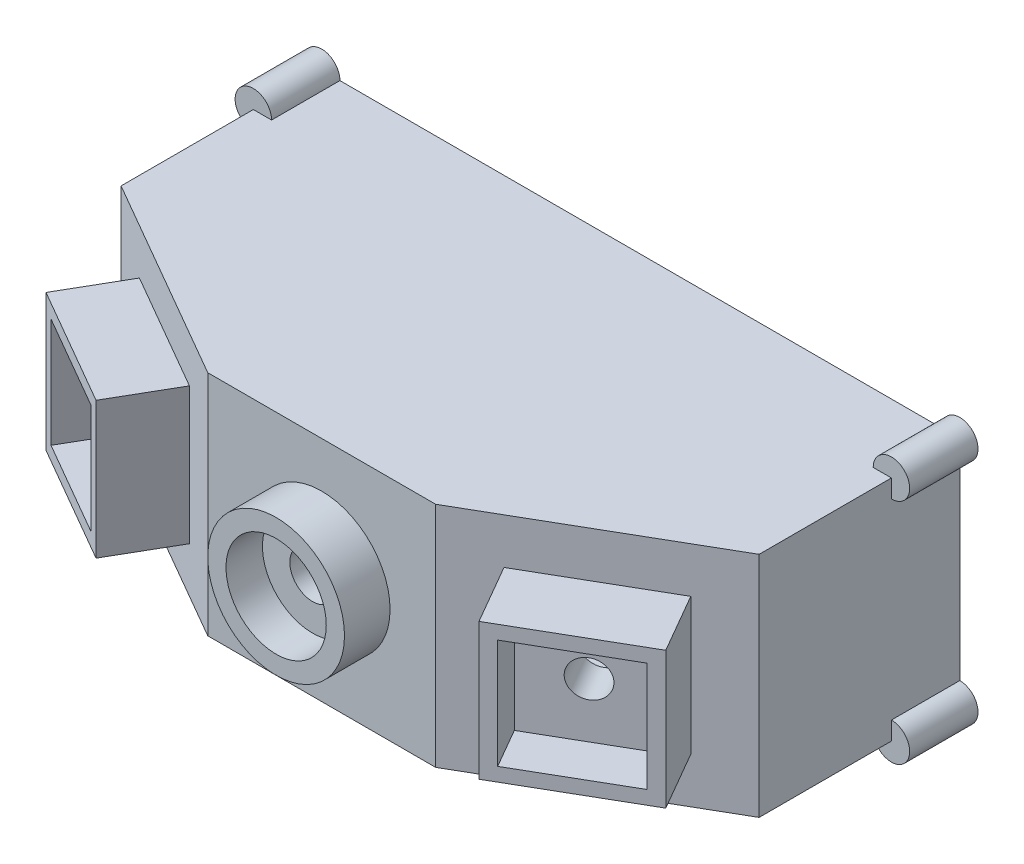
ISO-10303-21;
HEADER;
FILE_DESCRIPTION(('STEP AP214'),'2;1');
FILE_NAME('part.step','',(''),(''),'','','');
FILE_SCHEMA(('AUTOMOTIVE_DESIGN { 1 0 10303 214 1 1 1 1 }'));
ENDSEC;
DATA;
#1=APPLICATION_CONTEXT('core data for automotive mechanical design processes');
#2=APPLICATION_PROTOCOL_DEFINITION('international standard','automotive_design',2000,#1);
#3=PRODUCT_CONTEXT('',#1,'mechanical');
#4=PRODUCT('Part','Part','',(#3));
#5=PRODUCT_RELATED_PRODUCT_CATEGORY('part','',(#4));
#6=PRODUCT_DEFINITION_FORMATION('','',#4);
#7=PRODUCT_DEFINITION_CONTEXT('part definition',#1,'design');
#8=PRODUCT_DEFINITION('design','',#6,#7);
#9=PRODUCT_DEFINITION_SHAPE('','',#8);
#10=(LENGTH_UNIT() NAMED_UNIT(*) SI_UNIT(.MILLI.,.METRE.));
#11=(NAMED_UNIT(*) PLANE_ANGLE_UNIT() SI_UNIT($,.RADIAN.));
#12=(NAMED_UNIT(*) SI_UNIT($,.STERADIAN.) SOLID_ANGLE_UNIT());
#13=UNCERTAINTY_MEASURE_WITH_UNIT(LENGTH_MEASURE(1.E-05),#10,'distance_accuracy_value','');
#14=(GEOMETRIC_REPRESENTATION_CONTEXT(3) GLOBAL_UNCERTAINTY_ASSIGNED_CONTEXT((#13)) GLOBAL_UNIT_ASSIGNED_CONTEXT((#10,
#11,#12)) REPRESENTATION_CONTEXT('',''));
#15=CARTESIAN_POINT('',(0.,0.,0.));
#16=DIRECTION('',(0.,0.,1.));
#17=DIRECTION('',(1.,0.,0.));
#18=AXIS2_PLACEMENT_3D('',#15,#16,#17);
#19=CARTESIAN_POINT('',(28.9054445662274,0.,50.0656986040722));
#20=DIRECTION('',(0.499999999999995,0.,0.866025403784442));
#21=DIRECTION('',(-0.866025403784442,0.,0.499999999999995));
#22=AXIS2_PLACEMENT_3D('',#19,#20,#21);
#23=PLANE('',#22);
#24=DIRECTION('',(0.,-1.,0.));
#25=VECTOR('',#24,1.);
#26=CARTESIAN_POINT('',(67.9903810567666,10.,27.5000000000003));
#27=LINE('',#26,#25);
#28=CARTESIAN_POINT('',(67.9903810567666,40.,27.5000000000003));
#29=VERTEX_POINT('',#28);
#30=CARTESIAN_POINT('',(67.9903810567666,10.,27.5000000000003));
#31=VERTEX_POINT('',#30);
#32=EDGE_CURVE('E571',#29,#31,#27,.T.);
#33=ORIENTED_EDGE('',*,*,#32,.F.);
#34=DIRECTION('',(0.866025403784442,0.,-0.499999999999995));
#35=VECTOR('',#34,1.);
#36=CARTESIAN_POINT('',(42.0096189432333,40.,42.5000000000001));
#37=LINE('',#36,#35);
#38=CARTESIAN_POINT('',(42.0096189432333,40.,42.5000000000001));
#39=VERTEX_POINT('',#38);
#40=EDGE_CURVE('E573',#39,#29,#37,.T.);
#41=ORIENTED_EDGE('',*,*,#40,.F.);
#42=DIRECTION('',(0.,1.,0.));
#43=VECTOR('',#42,1.);
#44=CARTESIAN_POINT('',(42.0096189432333,10.,42.5000000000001));
#45=LINE('',#44,#43);
#46=CARTESIAN_POINT('',(42.0096189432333,10.,42.5000000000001));
#47=VERTEX_POINT('',#46);
#48=EDGE_CURVE('E579',#47,#39,#45,.T.);
#49=ORIENTED_EDGE('',*,*,#48,.F.);
#50=DIRECTION('',(-0.866025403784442,0.,0.499999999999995));
#51=VECTOR('',#50,1.);
#52=CARTESIAN_POINT('',(42.0096189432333,10.,42.5000000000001));
#53=LINE('',#52,#51);
#54=EDGE_CURVE('E582',#31,#47,#53,.T.);
#55=ORIENTED_EDGE('',*,*,#54,.F.);
#56=EDGE_LOOP('',(#33,#41,#49,#55));
#57=FACE_BOUND('',#56,.T.);
#58=DIRECTION('',(0.866025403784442,0.,-0.499999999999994));
#59=VECTOR('',#58,1.);
#60=CARTESIAN_POINT('',(44.6076951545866,37.,41.0000000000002));
#61=LINE('',#60,#59);
#62=CARTESIAN_POINT('',(44.6076951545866,37.,41.0000000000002));
#63=VERTEX_POINT('',#62);
#64=CARTESIAN_POINT('',(65.3923048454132,37.,29.0000000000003));
#65=VERTEX_POINT('',#64);
#66=EDGE_CURVE('E551',#63,#65,#61,.T.);
#67=ORIENTED_EDGE('',*,*,#66,.T.);
#68=DIRECTION('',(0.,-1.,0.));
#69=VECTOR('',#68,1.);
#70=CARTESIAN_POINT('',(65.3923048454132,13.,29.0000000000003));
#71=LINE('',#70,#69);
#72=CARTESIAN_POINT('',(65.3923048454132,13.,29.0000000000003));
#73=VERTEX_POINT('',#72);
#74=EDGE_CURVE('E536',#65,#73,#71,.T.);
#75=ORIENTED_EDGE('',*,*,#74,.T.);
#76=DIRECTION('',(-0.866025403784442,0.,0.499999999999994));
#77=VECTOR('',#76,1.);
#78=CARTESIAN_POINT('',(44.6076951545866,13.,41.0000000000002));
#79=LINE('',#78,#77);
#80=CARTESIAN_POINT('',(44.6076951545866,13.,41.0000000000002));
#81=VERTEX_POINT('',#80);
#82=EDGE_CURVE('E544',#73,#81,#79,.T.);
#83=ORIENTED_EDGE('',*,*,#82,.T.);
#84=DIRECTION('',(0.,1.,0.));
#85=VECTOR('',#84,1.);
#86=CARTESIAN_POINT('',(44.6076951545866,13.,41.0000000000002));
#87=LINE('',#86,#85);
#88=EDGE_CURVE('E558',#81,#63,#87,.T.);
#89=ORIENTED_EDGE('',*,*,#88,.T.);
#90=EDGE_LOOP('',(#67,#75,#83,#89));
#91=FACE_BOUND('',#90,.T.);
#92=ADVANCED_FACE('F41',(#57,#91),#23,.T.);
#93=CARTESIAN_POINT('',(-70.,0.,9.01923788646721));
#94=DIRECTION('',(0.499999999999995,0.,-0.866025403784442));
#95=DIRECTION('',(-0.866025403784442,0.,-0.499999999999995));
#96=AXIS2_PLACEMENT_3D('',#93,#94,#95);
#97=PLANE('',#96);
#98=DIRECTION('',(-0.866025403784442,0.,-0.499999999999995));
#99=VECTOR('',#98,1.);
#100=CARTESIAN_POINT('',(-70.,50.,9.01923788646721));
#101=LINE('',#100,#99);
#102=CARTESIAN_POINT('',(-25.,50.,35.));
#103=VERTEX_POINT('',#102);
#104=CARTESIAN_POINT('',(-70.,50.,9.01923788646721));
#105=VERTEX_POINT('',#104);
#106=EDGE_CURVE('E740',#103,#105,#101,.T.);
#107=ORIENTED_EDGE('',*,*,#106,.T.);
#108=DIRECTION('',(0.,1.,0.));
#109=VECTOR('',#108,1.);
#110=CARTESIAN_POINT('',(-70.,0.,9.01923788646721));
#111=LINE('',#110,#109);
#112=CARTESIAN_POINT('',(-70.,0.,9.01923788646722));
#113=VERTEX_POINT('',#112);
#114=EDGE_CURVE('E358',#113,#105,#111,.T.);
#115=ORIENTED_EDGE('',*,*,#114,.F.);
#116=DIRECTION('',(-0.866025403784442,0.,-0.499999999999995));
#117=VECTOR('',#116,1.);
#118=CARTESIAN_POINT('',(-70.,0.,9.01923788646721));
#119=LINE('',#118,#117);
#120=CARTESIAN_POINT('',(-25.,0.,35.));
#121=VERTEX_POINT('',#120);
#122=EDGE_CURVE('E351',#121,#113,#119,.T.);
#123=ORIENTED_EDGE('',*,*,#122,.F.);
#124=DIRECTION('',(0.,1.,0.));
#125=VECTOR('',#124,1.);
#126=CARTESIAN_POINT('',(-25.,0.,35.));
#127=LINE('',#126,#125);
#128=EDGE_CURVE('E738',#121,#103,#127,.T.);
#129=ORIENTED_EDGE('',*,*,#128,.T.);
#130=EDGE_LOOP('',(#107,#115,#123,#129));
#131=FACE_BOUND('',#130,.T.);
#132=DIRECTION('',(0.,-1.,0.));
#133=VECTOR('',#132,1.);
#134=CARTESIAN_POINT('',(-60.4903810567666,10.,14.5096189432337));
#135=LINE('',#134,#133);
#136=CARTESIAN_POINT('',(-60.4903810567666,40.,14.5096189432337));
#137=VERTEX_POINT('',#136);
#138=CARTESIAN_POINT('',(-60.4903810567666,10.,14.5096189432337));
#139=VERTEX_POINT('',#138);
#140=EDGE_CURVE('E634',#137,#139,#135,.T.);
#141=ORIENTED_EDGE('',*,*,#140,.F.);
#142=DIRECTION('',(-0.866025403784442,0.,-0.499999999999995));
#143=VECTOR('',#142,1.);
#144=CARTESIAN_POINT('',(-34.5096189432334,40.,29.5096189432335));
#145=LINE('',#144,#143);
#146=CARTESIAN_POINT('',(-34.5096189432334,40.,29.5096189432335));
#147=VERTEX_POINT('',#146);
#148=EDGE_CURVE('E647',#147,#137,#145,.T.);
#149=ORIENTED_EDGE('',*,*,#148,.F.);
#150=DIRECTION('',(0.,1.,0.));
#151=VECTOR('',#150,1.);
#152=CARTESIAN_POINT('',(-34.5096189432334,10.,29.5096189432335));
#153=LINE('',#152,#151);
#154=CARTESIAN_POINT('',(-34.5096189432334,10.,29.5096189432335));
#155=VERTEX_POINT('',#154);
#156=EDGE_CURVE('E658',#155,#147,#153,.T.);
#157=ORIENTED_EDGE('',*,*,#156,.F.);
#158=DIRECTION('',(0.866025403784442,0.,0.499999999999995));
#159=VECTOR('',#158,1.);
#160=CARTESIAN_POINT('',(-34.5096189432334,10.,29.5096189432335));
#161=LINE('',#160,#159);
#162=EDGE_CURVE('E652',#139,#155,#161,.T.);
#163=ORIENTED_EDGE('',*,*,#162,.F.);
#164=EDGE_LOOP('',(#141,#149,#157,#163));
#165=FACE_BOUND('',#164,.T.);
#166=ADVANCED_FACE('F752',(#131,#165),#97,.F.);
#167=CARTESIAN_POINT('',(70.,50.,-35.));
#168=DIRECTION('',(0.,0.,1.));
#169=DIRECTION('',(1.,0.,0.));
#170=AXIS2_PLACEMENT_3D('',#167,#168,#169);
#171=PLANE('',#170);
#172=CARTESIAN_POINT('',(70.,50.,-35.));
#173=DIRECTION('',(0.,0.,-1.));
#174=DIRECTION('',(-1.,0.,0.));
#175=AXIS2_PLACEMENT_3D('',#172,#173,#174);
#176=CIRCLE('',#175,1.25);
#177=CARTESIAN_POINT('',(68.75,50.,-35.));
#178=VERTEX_POINT('',#177);
#179=EDGE_CURVE('E1408',#178,#178,#176,.T.);
#180=ORIENTED_EDGE('',*,*,#179,.F.);
#181=EDGE_LOOP('',(#180));
#182=FACE_BOUND('',#181,.T.);
#183=CARTESIAN_POINT('',(70.,0.,-35.));
#184=DIRECTION('',(0.,0.,-1.));
#185=DIRECTION('',(-1.,0.,0.));
#186=AXIS2_PLACEMENT_3D('',#183,#184,#185);
#187=CIRCLE('',#186,1.25);
#188=CARTESIAN_POINT('',(68.75,0.,-35.));
#189=VERTEX_POINT('',#188);
#190=EDGE_CURVE('E1473',#189,#189,#187,.T.);
#191=ORIENTED_EDGE('',*,*,#190,.F.);
#192=EDGE_LOOP('',(#191));
#193=FACE_BOUND('',#192,.T.);
#194=CARTESIAN_POINT('',(-70.,0.,-35.));
#195=DIRECTION('',(0.,0.,-1.));
#196=DIRECTION('',(-1.,0.,0.));
#197=AXIS2_PLACEMENT_3D('',#194,#195,#196);
#198=CIRCLE('',#197,1.25);
#199=CARTESIAN_POINT('',(-71.25,0.,-35.));
#200=VERTEX_POINT('',#199);
#201=EDGE_CURVE('E1422',#200,#200,#198,.T.);
#202=ORIENTED_EDGE('',*,*,#201,.F.);
#203=EDGE_LOOP('',(#202));
#204=FACE_BOUND('',#203,.T.);
#205=CARTESIAN_POINT('',(-70.,50.,-35.));
#206=DIRECTION('',(0.,0.,-1.));
#207=DIRECTION('',(-1.,0.,0.));
#208=AXIS2_PLACEMENT_3D('',#205,#206,#207);
#209=CIRCLE('',#208,1.25);
#210=CARTESIAN_POINT('',(-71.25,50.,-35.));
#211=VERTEX_POINT('',#210);
#212=EDGE_CURVE('E1417',#211,#211,#209,.T.);
#213=ORIENTED_EDGE('',*,*,#212,.F.);
#214=EDGE_LOOP('',(#213));
#215=FACE_BOUND('',#214,.T.);
#216=CARTESIAN_POINT('',(70.,0.,-35.));
#217=DIRECTION('',(0.,0.,-1.));
#218=DIRECTION('',(-1.,0.,0.));
#219=AXIS2_PLACEMENT_3D('',#216,#217,#218);
#220=CIRCLE('',#219,4.00000000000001);
#221=CARTESIAN_POINT('',(70.,4.,-35.));
#222=VERTEX_POINT('',#221);
#223=CARTESIAN_POINT('',(66.,0.,-35.));
#224=VERTEX_POINT('',#223);
#225=EDGE_CURVE('E1430',#222,#224,#220,.T.);
#226=ORIENTED_EDGE('',*,*,#225,.T.);
#227=DIRECTION('',(-1.,0.,0.));
#228=VECTOR('',#227,1.);
#229=CARTESIAN_POINT('',(70.,0.,-35.));
#230=LINE('',#229,#228);
#231=CARTESIAN_POINT('',(-66.,0.,-35.));
#232=VERTEX_POINT('',#231);
#233=EDGE_CURVE('E401',#224,#232,#230,.T.);
#234=ORIENTED_EDGE('',*,*,#233,.T.);
#235=CARTESIAN_POINT('',(-70.,0.,-35.));
#236=DIRECTION('',(0.,0.,-1.));
#237=DIRECTION('',(-1.,0.,0.));
#238=AXIS2_PLACEMENT_3D('',#235,#236,#237);
#239=CIRCLE('',#238,4.00000000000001);
#240=CARTESIAN_POINT('',(-70.,4.,-35.));
#241=VERTEX_POINT('',#240);
#242=EDGE_CURVE('E1425',#232,#241,#239,.T.);
#243=ORIENTED_EDGE('',*,*,#242,.T.);
#244=DIRECTION('',(0.,-1.,0.));
#245=VECTOR('',#244,1.);
#246=CARTESIAN_POINT('',(-70.,50.,-35.));
#247=LINE('',#246,#245);
#248=CARTESIAN_POINT('',(-70.,46.,-35.));
#249=VERTEX_POINT('',#248);
#250=EDGE_CURVE('E418',#249,#241,#247,.T.);
#251=ORIENTED_EDGE('',*,*,#250,.F.);
#252=CARTESIAN_POINT('',(-70.,50.,-35.));
#253=DIRECTION('',(0.,0.,-1.));
#254=DIRECTION('',(-1.,0.,0.));
#255=AXIS2_PLACEMENT_3D('',#252,#253,#254);
#256=CIRCLE('',#255,4.00000000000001);
#257=CARTESIAN_POINT('',(-66.,50.,-35.));
#258=VERTEX_POINT('',#257);
#259=EDGE_CURVE('E1434',#249,#258,#256,.T.);
#260=ORIENTED_EDGE('',*,*,#259,.T.);
#261=DIRECTION('',(-1.,0.,0.));
#262=VECTOR('',#261,1.);
#263=CARTESIAN_POINT('',(70.,50.,-35.));
#264=LINE('',#263,#262);
#265=CARTESIAN_POINT('',(66.,50.,-35.));
#266=VERTEX_POINT('',#265);
#267=EDGE_CURVE('E420',#266,#258,#264,.T.);
#268=ORIENTED_EDGE('',*,*,#267,.F.);
#269=CARTESIAN_POINT('',(70.,50.,-35.));
#270=DIRECTION('',(0.,0.,-1.));
#271=DIRECTION('',(-1.,0.,0.));
#272=AXIS2_PLACEMENT_3D('',#269,#270,#271);
#273=CIRCLE('',#272,4.00000000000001);
#274=CARTESIAN_POINT('',(70.,46.,-35.));
#275=VERTEX_POINT('',#274);
#276=EDGE_CURVE('E1428',#266,#275,#273,.T.);
#277=ORIENTED_EDGE('',*,*,#276,.T.);
#278=DIRECTION('',(0.,-1.,0.));
#279=VECTOR('',#278,1.);
#280=CARTESIAN_POINT('',(70.,50.,-35.));
#281=LINE('',#280,#279);
#282=EDGE_CURVE('E425',#275,#222,#281,.T.);
#283=ORIENTED_EDGE('',*,*,#282,.T.);
#284=EDGE_LOOP('',(#226,#234,#243,#251,#260,#268,#277,#283));
#285=FACE_BOUND('',#284,.T.);
#286=DIRECTION('',(-1.,0.,0.));
#287=VECTOR('',#286,1.);
#288=CARTESIAN_POINT('',(70.,4.,-35.));
#289=LINE('',#288,#287);
#290=CARTESIAN_POINT('',(66.,4.,-35.));
#291=VERTEX_POINT('',#290);
#292=CARTESIAN_POINT('',(-66.,4.,-35.));
#293=VERTEX_POINT('',#292);
#294=EDGE_CURVE('E711',#291,#293,#289,.T.);
#295=ORIENTED_EDGE('',*,*,#294,.F.);
#296=DIRECTION('',(0.,-1.,0.));
#297=VECTOR('',#296,1.);
#298=CARTESIAN_POINT('',(66.,50.,-35.));
#299=LINE('',#298,#297);
#300=CARTESIAN_POINT('',(66.,46.,-35.));
#301=VERTEX_POINT('',#300);
#302=EDGE_CURVE('E726',#301,#291,#299,.T.);
#303=ORIENTED_EDGE('',*,*,#302,.F.);
#304=DIRECTION('',(-1.,0.,0.));
#305=VECTOR('',#304,1.);
#306=CARTESIAN_POINT('',(70.,46.,-35.));
#307=LINE('',#306,#305);
#308=CARTESIAN_POINT('',(-66.,46.,-35.));
#309=VERTEX_POINT('',#308);
#310=EDGE_CURVE('E712',#301,#309,#307,.T.);
#311=ORIENTED_EDGE('',*,*,#310,.T.);
#312=DIRECTION('',(0.,-1.,0.));
#313=VECTOR('',#312,1.);
#314=CARTESIAN_POINT('',(-66.,50.,-35.));
#315=LINE('',#314,#313);
#316=EDGE_CURVE('E730',#309,#293,#315,.T.);
#317=ORIENTED_EDGE('',*,*,#316,.T.);
#318=EDGE_LOOP('',(#295,#303,#311,#317));
#319=FACE_BOUND('',#318,.T.);
#320=ADVANCED_FACE('F823',(#182,#193,#204,#215,#285,#319),#171,.F.);
#321=CARTESIAN_POINT('',(70.,50.,35.));
#322=DIRECTION('',(0.,0.,-1.));
#323=DIRECTION('',(-1.,0.,0.));
#324=AXIS2_PLACEMENT_3D('',#321,#322,#323);
#325=PLANE('',#324);
#326=CARTESIAN_POINT('',(0.,25.,35.));
#327=DIRECTION('',(0.,0.,1.));
#328=DIRECTION('',(1.,0.,0.));
#329=AXIS2_PLACEMENT_3D('',#326,#327,#328);
#330=CIRCLE('',#329,15.);
#331=CARTESIAN_POINT('',(15.,25.,35.));
#332=VERTEX_POINT('',#331);
#333=EDGE_CURVE('E428',#332,#332,#330,.T.);
#334=ORIENTED_EDGE('',*,*,#333,.F.);
#335=EDGE_LOOP('',(#334));
#336=FACE_BOUND('',#335,.T.);
#337=ORIENTED_EDGE('',*,*,#128,.F.);
#338=DIRECTION('',(1.,0.,0.));
#339=VECTOR('',#338,1.);
#340=CARTESIAN_POINT('',(70.,0.,35.));
#341=LINE('',#340,#339);
#342=CARTESIAN_POINT('',(25.,0.,35.));
#343=VERTEX_POINT('',#342);
#344=EDGE_CURVE('E354',#121,#343,#341,.T.);
#345=ORIENTED_EDGE('',*,*,#344,.T.);
#346=DIRECTION('',(0.,1.,0.));
#347=VECTOR('',#346,1.);
#348=CARTESIAN_POINT('',(25.,0.,35.));
#349=LINE('',#348,#347);
#350=CARTESIAN_POINT('',(25.,50.,35.));
#351=VERTEX_POINT('',#350);
#352=EDGE_CURVE('E732',#343,#351,#349,.T.);
#353=ORIENTED_EDGE('',*,*,#352,.T.);
#354=DIRECTION('',(1.,0.,0.));
#355=VECTOR('',#354,1.);
#356=CARTESIAN_POINT('',(70.,50.,35.));
#357=LINE('',#356,#355);
#358=EDGE_CURVE('E405',#103,#351,#357,.T.);
#359=ORIENTED_EDGE('',*,*,#358,.F.);
#360=EDGE_LOOP('',(#337,#345,#353,#359));
#361=FACE_BOUND('',#360,.T.);
#362=ADVANCED_FACE('F755',(#336,#361),#325,.F.);
#363=CARTESIAN_POINT('',(70.,50.,35.));
#364=DIRECTION('',(-1.,0.,0.));
#365=DIRECTION('',(0.,0.,1.));
#366=AXIS2_PLACEMENT_3D('',#363,#364,#365);
#367=PLANE('',#366);
#368=DIRECTION('',(0.,-1.,0.));
#369=VECTOR('',#368,1.);
#370=CARTESIAN_POINT('',(70.,50.,-20.));
#371=LINE('',#370,#369);
#372=CARTESIAN_POINT('',(70.,4.,-20.));
#373=VERTEX_POINT('',#372);
#374=CARTESIAN_POINT('',(70.,0.,-20.));
#375=VERTEX_POINT('',#374);
#376=EDGE_CURVE('E57',#373,#375,#371,.T.);
#377=ORIENTED_EDGE('',*,*,#376,.F.);
#378=DIRECTION('',(0.,0.,-1.));
#379=VECTOR('',#378,1.);
#380=CARTESIAN_POINT('',(70.,4.00000000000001,-20.));
#381=LINE('',#380,#379);
#382=EDGE_CURVE('E58',#373,#222,#381,.T.);
#383=ORIENTED_EDGE('',*,*,#382,.T.);
#384=ORIENTED_EDGE('',*,*,#282,.F.);
#385=DIRECTION('',(0.,0.,-1.));
#386=VECTOR('',#385,1.);
#387=CARTESIAN_POINT('',(70.,46.,-20.));
#388=LINE('',#387,#386);
#389=CARTESIAN_POINT('',(70.,46.,-20.));
#390=VERTEX_POINT('',#389);
#391=EDGE_CURVE('E765',#275,#390,#388,.F.);
#392=ORIENTED_EDGE('',*,*,#391,.T.);
#393=DIRECTION('',(0.,-1.,0.));
#394=VECTOR('',#393,1.);
#395=CARTESIAN_POINT('',(70.,50.,-20.));
#396=LINE('',#395,#394);
#397=CARTESIAN_POINT('',(70.,50.,-20.));
#398=VERTEX_POINT('',#397);
#399=EDGE_CURVE('E761',#398,#390,#396,.T.);
#400=ORIENTED_EDGE('',*,*,#399,.F.);
#401=DIRECTION('',(0.,0.,-1.));
#402=VECTOR('',#401,1.);
#403=CARTESIAN_POINT('',(70.,50.,35.));
#404=LINE('',#403,#402);
#405=CARTESIAN_POINT('',(70.,50.,9.01923788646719));
#406=VERTEX_POINT('',#405);
#407=EDGE_CURVE('E407',#406,#398,#404,.T.);
#408=ORIENTED_EDGE('',*,*,#407,.F.);
#409=DIRECTION('',(0.,1.,0.));
#410=VECTOR('',#409,1.);
#411=CARTESIAN_POINT('',(70.,0.,9.01923788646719));
#412=LINE('',#411,#410);
#413=CARTESIAN_POINT('',(70.,0.,9.01923788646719));
#414=VERTEX_POINT('',#413);
#415=EDGE_CURVE('E745',#414,#406,#412,.T.);
#416=ORIENTED_EDGE('',*,*,#415,.F.);
#417=DIRECTION('',(0.,0.,-1.));
#418=VECTOR('',#417,1.);
#419=CARTESIAN_POINT('',(70.,0.,35.));
#420=LINE('',#419,#418);
#421=EDGE_CURVE('E406',#414,#375,#420,.T.);
#422=ORIENTED_EDGE('',*,*,#421,.T.);
#423=EDGE_LOOP('',(#377,#383,#384,#392,#400,#408,#416,#422));
#424=FACE_BOUND('',#423,.T.);
#425=ADVANCED_FACE('F757',(#424),#367,.F.);
#426=CARTESIAN_POINT('',(-70.,50.,35.));
#427=DIRECTION('',(1.,0.,0.));
#428=DIRECTION('',(0.,0.,-1.));
#429=AXIS2_PLACEMENT_3D('',#426,#427,#428);
#430=PLANE('',#429);
#431=DIRECTION('',(0.,1.,0.));
#432=VECTOR('',#431,1.);
#433=CARTESIAN_POINT('',(-70.,50.,-20.));
#434=LINE('',#433,#432);
#435=CARTESIAN_POINT('',(-70.,46.,-20.));
#436=VERTEX_POINT('',#435);
#437=CARTESIAN_POINT('',(-70.,50.,-20.));
#438=VERTEX_POINT('',#437);
#439=EDGE_CURVE('E402',#436,#438,#434,.T.);
#440=ORIENTED_EDGE('',*,*,#439,.F.);
#441=DIRECTION('',(0.,0.,-1.));
#442=VECTOR('',#441,1.);
#443=CARTESIAN_POINT('',(-70.,46.,-20.));
#444=LINE('',#443,#442);
#445=EDGE_CURVE('E521',#436,#249,#444,.T.);
#446=ORIENTED_EDGE('',*,*,#445,.T.);
#447=ORIENTED_EDGE('',*,*,#250,.T.);
#448=DIRECTION('',(0.,0.,-1.));
#449=VECTOR('',#448,1.);
#450=CARTESIAN_POINT('',(-70.,4.00000000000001,-20.));
#451=LINE('',#450,#449);
#452=CARTESIAN_POINT('',(-70.,4.,-20.));
#453=VERTEX_POINT('',#452);
#454=EDGE_CURVE('E365',#241,#453,#451,.F.);
#455=ORIENTED_EDGE('',*,*,#454,.T.);
#456=DIRECTION('',(0.,1.,0.));
#457=VECTOR('',#456,1.);
#458=CARTESIAN_POINT('',(-70.,50.,-20.));
#459=LINE('',#458,#457);
#460=CARTESIAN_POINT('',(-70.,0.,-20.));
#461=VERTEX_POINT('',#460);
#462=EDGE_CURVE('E360',#461,#453,#459,.T.);
#463=ORIENTED_EDGE('',*,*,#462,.F.);
#464=DIRECTION('',(0.,0.,1.));
#465=VECTOR('',#464,1.);
#466=CARTESIAN_POINT('',(-70.,0.,35.));
#467=LINE('',#466,#465);
#468=EDGE_CURVE('E341',#461,#113,#467,.T.);
#469=ORIENTED_EDGE('',*,*,#468,.T.);
#470=ORIENTED_EDGE('',*,*,#114,.T.);
#471=DIRECTION('',(0.,0.,1.));
#472=VECTOR('',#471,1.);
#473=CARTESIAN_POINT('',(-70.,50.,35.));
#474=LINE('',#473,#472);
#475=EDGE_CURVE('E394',#438,#105,#474,.T.);
#476=ORIENTED_EDGE('',*,*,#475,.F.);
#477=EDGE_LOOP('',(#440,#446,#447,#455,#463,#469,#470,#476));
#478=FACE_BOUND('',#477,.T.);
#479=ADVANCED_FACE('F43',(#478),#430,.F.);
#480=CARTESIAN_POINT('',(0.,50.,0.));
#481=DIRECTION('',(0.,1.,0.));
#482=DIRECTION('',(0.,0.,1.));
#483=AXIS2_PLACEMENT_3D('',#480,#481,#482);
#484=PLANE('',#483);
#485=DIRECTION('',(0.,0.,-1.));
#486=VECTOR('',#485,1.);
#487=CARTESIAN_POINT('',(-66.,50.,-20.));
#488=LINE('',#487,#486);
#489=CARTESIAN_POINT('',(-66.,50.,-20.));
#490=VERTEX_POINT('',#489);
#491=EDGE_CURVE('E11',#490,#258,#488,.T.);
#492=ORIENTED_EDGE('',*,*,#491,.F.);
#493=DIRECTION('',(-1.,0.,0.));
#494=VECTOR('',#493,1.);
#495=CARTESIAN_POINT('',(0.,50.,-20.));
#496=LINE('',#495,#494);
#497=EDGE_CURVE('E47',#490,#438,#496,.T.);
#498=ORIENTED_EDGE('',*,*,#497,.T.);
#499=ORIENTED_EDGE('',*,*,#475,.T.);
#500=ORIENTED_EDGE('',*,*,#106,.F.);
#501=ORIENTED_EDGE('',*,*,#358,.T.);
#502=DIRECTION('',(-0.866025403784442,0.,0.499999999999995));
#503=VECTOR('',#502,1.);
#504=CARTESIAN_POINT('',(70.,50.,9.01923788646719));
#505=LINE('',#504,#503);
#506=EDGE_CURVE('E739',#406,#351,#505,.T.);
#507=ORIENTED_EDGE('',*,*,#506,.F.);
#508=ORIENTED_EDGE('',*,*,#407,.T.);
#509=DIRECTION('',(-1.,0.,0.));
#510=VECTOR('',#509,1.);
#511=CARTESIAN_POINT('',(0.,50.,-20.));
#512=LINE('',#511,#510);
#513=CARTESIAN_POINT('',(66.,50.,-20.));
#514=VERTEX_POINT('',#513);
#515=EDGE_CURVE('E384',#398,#514,#512,.T.);
#516=ORIENTED_EDGE('',*,*,#515,.T.);
#517=DIRECTION('',(0.,0.,-1.));
#518=VECTOR('',#517,1.);
#519=CARTESIAN_POINT('',(66.,50.,-20.));
#520=LINE('',#519,#518);
#521=EDGE_CURVE('E387',#266,#514,#520,.F.);
#522=ORIENTED_EDGE('',*,*,#521,.F.);
#523=ORIENTED_EDGE('',*,*,#267,.T.);
#524=EDGE_LOOP('',(#492,#498,#499,#500,#501,#507,#508,#516,#522,#523));
#525=FACE_BOUND('',#524,.T.);
#526=ADVANCED_FACE('F395',(#525),#484,.T.);
#527=CARTESIAN_POINT('',(0.,0.,0.));
#528=DIRECTION('',(0.,1.,0.));
#529=DIRECTION('',(0.,0.,1.));
#530=AXIS2_PLACEMENT_3D('',#527,#528,#529);
#531=PLANE('',#530);
#532=DIRECTION('',(1.,0.,0.));
#533=VECTOR('',#532,1.);
#534=CARTESIAN_POINT('',(-7.5,0.,4.50961894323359));
#535=LINE('',#534,#533);
#536=CARTESIAN_POINT('',(-7.5,0.,4.50961894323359));
#537=VERTEX_POINT('',#536);
#538=CARTESIAN_POINT('',(7.5,0.,4.50961894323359));
#539=VERTEX_POINT('',#538);
#540=EDGE_CURVE('E774',#537,#539,#535,.T.);
#541=ORIENTED_EDGE('',*,*,#540,.F.);
#542=CARTESIAN_POINT('',(-7.5,0.,7.00961894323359));
#543=DIRECTION('',(0.,-1.,0.));
#544=DIRECTION('',(0.,0.,-1.));
#545=AXIS2_PLACEMENT_3D('',#542,#543,#544);
#546=CIRCLE('',#545,2.5);
#547=CARTESIAN_POINT('',(-7.5,0.,9.50961894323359));
#548=VERTEX_POINT('',#547);
#549=EDGE_CURVE('E488',#548,#537,#546,.T.);
#550=ORIENTED_EDGE('',*,*,#549,.F.);
#551=DIRECTION('',(-1.,0.,0.));
#552=VECTOR('',#551,1.);
#553=CARTESIAN_POINT('',(-7.5,0.,9.50961894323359));
#554=LINE('',#553,#552);
#555=CARTESIAN_POINT('',(7.5,0.,9.50961894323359));
#556=VERTEX_POINT('',#555);
#557=EDGE_CURVE('E487',#556,#548,#554,.T.);
#558=ORIENTED_EDGE('',*,*,#557,.F.);
#559=CARTESIAN_POINT('',(7.5,0.,7.00961894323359));
#560=DIRECTION('',(0.,-1.,0.));
#561=DIRECTION('',(0.,0.,-1.));
#562=AXIS2_PLACEMENT_3D('',#559,#560,#561);
#563=CIRCLE('',#562,2.5);
#564=EDGE_CURVE('E468',#539,#556,#563,.T.);
#565=ORIENTED_EDGE('',*,*,#564,.F.);
#566=EDGE_LOOP('',(#541,#550,#558,#565));
#567=FACE_BOUND('',#566,.T.);
#568=DIRECTION('',(1.,0.,0.));
#569=VECTOR('',#568,1.);
#570=CARTESIAN_POINT('',(-7.5,0.,-5.49038105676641));
#571=LINE('',#570,#569);
#572=CARTESIAN_POINT('',(-7.5,0.,-5.49038105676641));
#573=VERTEX_POINT('',#572);
#574=CARTESIAN_POINT('',(7.5,0.,-5.49038105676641));
#575=VERTEX_POINT('',#574);
#576=EDGE_CURVE('E507',#573,#575,#571,.T.);
#577=ORIENTED_EDGE('',*,*,#576,.F.);
#578=CARTESIAN_POINT('',(-7.5,0.,-2.99038105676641));
#579=DIRECTION('',(0.,-1.,0.));
#580=DIRECTION('',(0.,0.,-1.));
#581=AXIS2_PLACEMENT_3D('',#578,#579,#580);
#582=CIRCLE('',#581,2.5);
#583=CARTESIAN_POINT('',(-7.5,0.,-0.490381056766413));
#584=VERTEX_POINT('',#583);
#585=EDGE_CURVE('E512',#584,#573,#582,.T.);
#586=ORIENTED_EDGE('',*,*,#585,.F.);
#587=DIRECTION('',(-1.,0.,0.));
#588=VECTOR('',#587,1.);
#589=CARTESIAN_POINT('',(-7.5,0.,-0.490381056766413));
#590=LINE('',#589,#588);
#591=CARTESIAN_POINT('',(7.5,0.,-0.490381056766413));
#592=VERTEX_POINT('',#591);
#593=EDGE_CURVE('E492',#592,#584,#590,.T.);
#594=ORIENTED_EDGE('',*,*,#593,.F.);
#595=CARTESIAN_POINT('',(7.5,0.,-2.99038105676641));
#596=DIRECTION('',(0.,-1.,0.));
#597=DIRECTION('',(0.,0.,-1.));
#598=AXIS2_PLACEMENT_3D('',#595,#596,#597);
#599=CIRCLE('',#598,2.5);
#600=EDGE_CURVE('E504',#575,#592,#599,.T.);
#601=ORIENTED_EDGE('',*,*,#600,.F.);
#602=EDGE_LOOP('',(#577,#586,#594,#601));
#603=FACE_BOUND('',#602,.T.);
#604=DIRECTION('',(1.,0.,0.));
#605=VECTOR('',#604,1.);
#606=CARTESIAN_POINT('',(-7.5,0.,-15.4903810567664));
#607=LINE('',#606,#605);
#608=CARTESIAN_POINT('',(-7.5,0.,-15.4903810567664));
#609=VERTEX_POINT('',#608);
#610=CARTESIAN_POINT('',(7.5,0.,-15.4903810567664));
#611=VERTEX_POINT('',#610);
#612=EDGE_CURVE('E527',#609,#611,#607,.T.);
#613=ORIENTED_EDGE('',*,*,#612,.F.);
#614=CARTESIAN_POINT('',(-7.5,0.,-12.9903810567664));
#615=DIRECTION('',(0.,-1.,0.));
#616=DIRECTION('',(0.,0.,-1.));
#617=AXIS2_PLACEMENT_3D('',#614,#615,#616);
#618=CIRCLE('',#617,2.5);
#619=CARTESIAN_POINT('',(-7.5,0.,-10.4903810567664));
#620=VERTEX_POINT('',#619);
#621=EDGE_CURVE('E505',#620,#609,#618,.T.);
#622=ORIENTED_EDGE('',*,*,#621,.F.);
#623=DIRECTION('',(-1.,0.,0.));
#624=VECTOR('',#623,1.);
#625=CARTESIAN_POINT('',(-7.5,0.,-10.4903810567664));
#626=LINE('',#625,#624);
#627=CARTESIAN_POINT('',(7.5,0.,-10.4903810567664));
#628=VERTEX_POINT('',#627);
#629=EDGE_CURVE('E517',#628,#620,#626,.T.);
#630=ORIENTED_EDGE('',*,*,#629,.F.);
#631=CARTESIAN_POINT('',(7.5,0.,-12.9903810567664));
#632=DIRECTION('',(0.,-1.,0.));
#633=DIRECTION('',(0.,0.,-1.));
#634=AXIS2_PLACEMENT_3D('',#631,#632,#633);
#635=CIRCLE('',#634,2.5);
#636=EDGE_CURVE('E526',#611,#628,#635,.T.);
#637=ORIENTED_EDGE('',*,*,#636,.F.);
#638=EDGE_LOOP('',(#613,#622,#630,#637));
#639=FACE_BOUND('',#638,.T.);
#640=ORIENTED_EDGE('',*,*,#233,.F.);
#641=DIRECTION('',(0.,0.,-1.));
#642=VECTOR('',#641,1.);
#643=CARTESIAN_POINT('',(66.,0.,-20.));
#644=LINE('',#643,#642);
#645=CARTESIAN_POINT('',(66.,0.,-20.));
#646=VERTEX_POINT('',#645);
#647=EDGE_CURVE('E382',#224,#646,#644,.F.);
#648=ORIENTED_EDGE('',*,*,#647,.T.);
#649=DIRECTION('',(-1.,0.,0.));
#650=VECTOR('',#649,1.);
#651=CARTESIAN_POINT('',(0.,0.,-20.));
#652=LINE('',#651,#650);
#653=EDGE_CURVE('E373',#375,#646,#652,.T.);
#654=ORIENTED_EDGE('',*,*,#653,.F.);
#655=ORIENTED_EDGE('',*,*,#421,.F.);
#656=DIRECTION('',(-0.866025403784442,0.,0.499999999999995));
#657=VECTOR('',#656,1.);
#658=CARTESIAN_POINT('',(70.,0.,9.01923788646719));
#659=LINE('',#658,#657);
#660=EDGE_CURVE('E415',#414,#343,#659,.T.);
#661=ORIENTED_EDGE('',*,*,#660,.T.);
#662=ORIENTED_EDGE('',*,*,#344,.F.);
#663=ORIENTED_EDGE('',*,*,#122,.T.);
#664=ORIENTED_EDGE('',*,*,#468,.F.);
#665=DIRECTION('',(-1.,0.,0.));
#666=VECTOR('',#665,1.);
#667=CARTESIAN_POINT('',(0.,0.,-20.));
#668=LINE('',#667,#666);
#669=CARTESIAN_POINT('',(-66.,0.,-20.));
#670=VERTEX_POINT('',#669);
#671=EDGE_CURVE('E346',#670,#461,#668,.T.);
#672=ORIENTED_EDGE('',*,*,#671,.F.);
#673=DIRECTION('',(0.,0.,-1.));
#674=VECTOR('',#673,1.);
#675=CARTESIAN_POINT('',(-66.,0.,-20.));
#676=LINE('',#675,#674);
#677=EDGE_CURVE('E369',#670,#232,#676,.T.);
#678=ORIENTED_EDGE('',*,*,#677,.T.);
#679=EDGE_LOOP('',(#640,#648,#654,#655,#661,#662,#663,#664,#672,#678));
#680=FACE_BOUND('',#679,.T.);
#681=ADVANCED_FACE('F348',(#567,#603,#639,#680),#531,.F.);
#682=CARTESIAN_POINT('',(70.,0.,9.01923788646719));
#683=DIRECTION('',(-0.499999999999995,0.,-0.866025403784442));
#684=DIRECTION('',(-0.866025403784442,0.,0.499999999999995));
#685=AXIS2_PLACEMENT_3D('',#682,#683,#684);
#686=PLANE('',#685);
#687=DIRECTION('',(0.866025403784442,0.,-0.499999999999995));
#688=VECTOR('',#687,1.);
#689=CARTESIAN_POINT('',(34.5096189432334,40.,29.5096189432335));
#690=LINE('',#689,#688);
#691=CARTESIAN_POINT('',(34.5096189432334,40.,29.5096189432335));
#692=VERTEX_POINT('',#691);
#693=CARTESIAN_POINT('',(60.4903810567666,40.,14.5096189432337));
#694=VERTEX_POINT('',#693);
#695=EDGE_CURVE('E590',#692,#694,#690,.T.);
#696=ORIENTED_EDGE('',*,*,#695,.T.);
#697=DIRECTION('',(0.,-1.,0.));
#698=VECTOR('',#697,1.);
#699=CARTESIAN_POINT('',(60.4903810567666,10.,14.5096189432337));
#700=LINE('',#699,#698);
#701=CARTESIAN_POINT('',(60.4903810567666,10.,14.5096189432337));
#702=VERTEX_POINT('',#701);
#703=EDGE_CURVE('E562',#694,#702,#700,.T.);
#704=ORIENTED_EDGE('',*,*,#703,.T.);
#705=DIRECTION('',(-0.866025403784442,0.,0.499999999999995));
#706=VECTOR('',#705,1.);
#707=CARTESIAN_POINT('',(34.5096189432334,10.,29.5096189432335));
#708=LINE('',#707,#706);
#709=CARTESIAN_POINT('',(34.5096189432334,10.,29.5096189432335));
#710=VERTEX_POINT('',#709);
#711=EDGE_CURVE('E574',#702,#710,#708,.T.);
#712=ORIENTED_EDGE('',*,*,#711,.T.);
#713=DIRECTION('',(0.,1.,0.));
#714=VECTOR('',#713,1.);
#715=CARTESIAN_POINT('',(34.5096189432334,10.,29.5096189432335));
#716=LINE('',#715,#714);
#717=EDGE_CURVE('E587',#710,#692,#716,.T.);
#718=ORIENTED_EDGE('',*,*,#717,.T.);
#719=EDGE_LOOP('',(#696,#704,#712,#718));
#720=FACE_BOUND('',#719,.T.);
#721=ORIENTED_EDGE('',*,*,#506,.T.);
#722=ORIENTED_EDGE('',*,*,#352,.F.);
#723=ORIENTED_EDGE('',*,*,#660,.F.);
#724=ORIENTED_EDGE('',*,*,#415,.T.);
#725=EDGE_LOOP('',(#721,#722,#723,#724));
#726=FACE_BOUND('',#725,.T.);
#727=ADVANCED_FACE('F776',(#720,#726),#686,.F.);
#728=CARTESIAN_POINT('',(70.,50.,31.));
#729=DIRECTION('',(0.,0.,-1.));
#730=DIRECTION('',(-1.,0.,0.));
#731=AXIS2_PLACEMENT_3D('',#728,#729,#730);
#732=PLANE('',#731);
#733=CARTESIAN_POINT('',(0.,25.,31.));
#734=DIRECTION('',(0.,0.,-1.));
#735=DIRECTION('',(-1.,0.,0.));
#736=AXIS2_PLACEMENT_3D('',#733,#734,#735);
#737=CIRCLE('',#736,5.);
#738=CARTESIAN_POINT('',(-5.,25.,31.));
#739=VERTEX_POINT('',#738);
#740=EDGE_CURVE('E430',#739,#739,#737,.T.);
#741=ORIENTED_EDGE('',*,*,#740,.F.);
#742=EDGE_LOOP('',(#741));
#743=FACE_BOUND('',#742,.T.);
#744=DIRECTION('',(0.,1.,0.));
#745=VECTOR('',#744,1.);
#746=CARTESIAN_POINT('',(-23.9282032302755,0.,31.));
#747=LINE('',#746,#745);
#748=CARTESIAN_POINT('',(-23.9282032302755,4.,31.));
#749=VERTEX_POINT('',#748);
#750=CARTESIAN_POINT('',(-23.9282032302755,46.,31.));
#751=VERTEX_POINT('',#750);
#752=EDGE_CURVE('E690',#749,#751,#747,.T.);
#753=ORIENTED_EDGE('',*,*,#752,.T.);
#754=DIRECTION('',(1.,0.,0.));
#755=VECTOR('',#754,1.);
#756=CARTESIAN_POINT('',(70.,46.,31.));
#757=LINE('',#756,#755);
#758=CARTESIAN_POINT('',(23.9282032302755,46.,31.));
#759=VERTEX_POINT('',#758);
#760=EDGE_CURVE('E697',#751,#759,#757,.T.);
#761=ORIENTED_EDGE('',*,*,#760,.T.);
#762=DIRECTION('',(0.,1.,0.));
#763=VECTOR('',#762,1.);
#764=CARTESIAN_POINT('',(23.9282032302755,50.,31.));
#765=LINE('',#764,#763);
#766=CARTESIAN_POINT('',(23.9282032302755,4.,31.));
#767=VERTEX_POINT('',#766);
#768=EDGE_CURVE('E685',#767,#759,#765,.T.);
#769=ORIENTED_EDGE('',*,*,#768,.F.);
#770=DIRECTION('',(1.,0.,0.));
#771=VECTOR('',#770,1.);
#772=CARTESIAN_POINT('',(70.,4.,31.));
#773=LINE('',#772,#771);
#774=EDGE_CURVE('E691',#749,#767,#773,.T.);
#775=ORIENTED_EDGE('',*,*,#774,.F.);
#776=EDGE_LOOP('',(#753,#761,#769,#775));
#777=FACE_BOUND('',#776,.T.);
#778=ADVANCED_FACE('F913',(#743,#777),#732,.T.);
#779=CARTESIAN_POINT('',(66.,50.,35.));
#780=DIRECTION('',(-1.,0.,0.));
#781=DIRECTION('',(0.,0.,1.));
#782=AXIS2_PLACEMENT_3D('',#779,#780,#781);
#783=PLANE('',#782);
#784=DIRECTION('',(0.,1.,0.));
#785=VECTOR('',#784,1.);
#786=CARTESIAN_POINT('',(66.,0.,6.70983680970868));
#787=LINE('',#786,#785);
#788=CARTESIAN_POINT('',(66.,4.,6.70983680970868));
#789=VERTEX_POINT('',#788);
#790=CARTESIAN_POINT('',(66.,46.,6.70983680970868));
#791=VERTEX_POINT('',#790);
#792=EDGE_CURVE('E698',#789,#791,#787,.T.);
#793=ORIENTED_EDGE('',*,*,#792,.T.);
#794=DIRECTION('',(0.,0.,-1.));
#795=VECTOR('',#794,1.);
#796=CARTESIAN_POINT('',(66.,46.,35.));
#797=LINE('',#796,#795);
#798=EDGE_CURVE('E705',#791,#301,#797,.T.);
#799=ORIENTED_EDGE('',*,*,#798,.T.);
#800=ORIENTED_EDGE('',*,*,#302,.T.);
#801=DIRECTION('',(0.,0.,-1.));
#802=VECTOR('',#801,1.);
#803=CARTESIAN_POINT('',(66.,4.,35.));
#804=LINE('',#803,#802);
#805=EDGE_CURVE('E692',#789,#291,#804,.T.);
#806=ORIENTED_EDGE('',*,*,#805,.F.);
#807=EDGE_LOOP('',(#793,#799,#800,#806));
#808=FACE_BOUND('',#807,.T.);
#809=ADVANCED_FACE('F914',(#808),#783,.T.);
#810=CARTESIAN_POINT('',(-66.,50.,35.));
#811=DIRECTION('',(1.,0.,0.));
#812=DIRECTION('',(0.,0.,-1.));
#813=AXIS2_PLACEMENT_3D('',#810,#811,#812);
#814=PLANE('',#813);
#815=DIRECTION('',(0.,0.,1.));
#816=VECTOR('',#815,1.);
#817=CARTESIAN_POINT('',(-66.,4.,35.));
#818=LINE('',#817,#816);
#819=CARTESIAN_POINT('',(-66.,4.,6.7098368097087));
#820=VERTEX_POINT('',#819);
#821=EDGE_CURVE('E694',#293,#820,#818,.T.);
#822=ORIENTED_EDGE('',*,*,#821,.F.);
#823=ORIENTED_EDGE('',*,*,#316,.F.);
#824=DIRECTION('',(0.,0.,1.));
#825=VECTOR('',#824,1.);
#826=CARTESIAN_POINT('',(-66.,46.,35.));
#827=LINE('',#826,#825);
#828=CARTESIAN_POINT('',(-66.,46.,6.7098368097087));
#829=VERTEX_POINT('',#828);
#830=EDGE_CURVE('E702',#309,#829,#827,.T.);
#831=ORIENTED_EDGE('',*,*,#830,.T.);
#832=DIRECTION('',(0.,1.,0.));
#833=VECTOR('',#832,1.);
#834=CARTESIAN_POINT('',(-66.,50.,6.7098368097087));
#835=LINE('',#834,#833);
#836=EDGE_CURVE('E689',#820,#829,#835,.T.);
#837=ORIENTED_EDGE('',*,*,#836,.F.);
#838=EDGE_LOOP('',(#822,#823,#831,#837));
#839=FACE_BOUND('',#838,.T.);
#840=ADVANCED_FACE('F918',(#839),#814,.T.);
#841=CARTESIAN_POINT('',(0.,46.,0.));
#842=DIRECTION('',(0.,1.,0.));
#843=DIRECTION('',(0.,0.,1.));
#844=AXIS2_PLACEMENT_3D('',#841,#842,#843);
#845=PLANE('',#844);
#846=DIRECTION('',(-0.866025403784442,0.,-0.499999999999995));
#847=VECTOR('',#846,1.);
#848=CARTESIAN_POINT('',(-19.4054445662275,46.,33.6112159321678));
#849=LINE('',#848,#847);
#850=EDGE_CURVE('E703',#751,#829,#849,.T.);
#851=ORIENTED_EDGE('',*,*,#850,.T.);
#852=ORIENTED_EDGE('',*,*,#830,.F.);
#853=ORIENTED_EDGE('',*,*,#310,.F.);
#854=ORIENTED_EDGE('',*,*,#798,.F.);
#855=DIRECTION('',(-0.866025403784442,0.,0.499999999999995));
#856=VECTOR('',#855,1.);
#857=CARTESIAN_POINT('',(19.4054445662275,46.,33.6112159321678));
#858=LINE('',#857,#856);
#859=EDGE_CURVE('E707',#791,#759,#858,.T.);
#860=ORIENTED_EDGE('',*,*,#859,.T.);
#861=ORIENTED_EDGE('',*,*,#760,.F.);
#862=EDGE_LOOP('',(#851,#852,#853,#854,#860,#861));
#863=FACE_BOUND('',#862,.T.);
#864=ADVANCED_FACE('F925',(#863),#845,.F.);
#865=CARTESIAN_POINT('',(0.,4.,0.));
#866=DIRECTION('',(0.,1.,0.));
#867=DIRECTION('',(0.,0.,1.));
#868=AXIS2_PLACEMENT_3D('',#865,#866,#867);
#869=PLANE('',#868);
#870=CARTESIAN_POINT('',(-7.5,4.,7.00961894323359));
#871=DIRECTION('',(0.,1.,0.));
#872=DIRECTION('',(0.,0.,1.));
#873=AXIS2_PLACEMENT_3D('',#870,#871,#872);
#874=CIRCLE('',#873,2.5);
#875=CARTESIAN_POINT('',(-7.5,4.,4.50961894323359));
#876=VERTEX_POINT('',#875);
#877=CARTESIAN_POINT('',(-7.5,4.,9.50961894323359));
#878=VERTEX_POINT('',#877);
#879=EDGE_CURVE('E371',#876,#878,#874,.T.);
#880=ORIENTED_EDGE('',*,*,#879,.F.);
#881=DIRECTION('',(-1.,0.,0.));
#882=VECTOR('',#881,1.);
#883=CARTESIAN_POINT('',(0.,4.,4.50961894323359));
#884=LINE('',#883,#882);
#885=CARTESIAN_POINT('',(7.5,4.,4.50961894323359));
#886=VERTEX_POINT('',#885);
#887=EDGE_CURVE('E448',#886,#876,#884,.T.);
#888=ORIENTED_EDGE('',*,*,#887,.F.);
#889=CARTESIAN_POINT('',(7.5,4.,7.00961894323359));
#890=DIRECTION('',(0.,1.,0.));
#891=DIRECTION('',(0.,0.,1.));
#892=AXIS2_PLACEMENT_3D('',#889,#890,#891);
#893=CIRCLE('',#892,2.5);
#894=CARTESIAN_POINT('',(7.5,4.,9.50961894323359));
#895=VERTEX_POINT('',#894);
#896=EDGE_CURVE('E455',#895,#886,#893,.T.);
#897=ORIENTED_EDGE('',*,*,#896,.F.);
#898=DIRECTION('',(1.,0.,0.));
#899=VECTOR('',#898,1.);
#900=CARTESIAN_POINT('',(0.,4.,9.50961894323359));
#901=LINE('',#900,#899);
#902=EDGE_CURVE('E374',#878,#895,#901,.T.);
#903=ORIENTED_EDGE('',*,*,#902,.F.);
#904=EDGE_LOOP('',(#880,#888,#897,#903));
#905=FACE_BOUND('',#904,.T.);
#906=CARTESIAN_POINT('',(-7.5,4.,-2.99038105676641));
#907=DIRECTION('',(0.,1.,0.));
#908=DIRECTION('',(0.,0.,1.));
#909=AXIS2_PLACEMENT_3D('',#906,#907,#908);
#910=CIRCLE('',#909,2.5);
#911=CARTESIAN_POINT('',(-7.5,4.,-5.49038105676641));
#912=VERTEX_POINT('',#911);
#913=CARTESIAN_POINT('',(-7.5,4.,-0.490381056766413));
#914=VERTEX_POINT('',#913);
#915=EDGE_CURVE('E449',#912,#914,#910,.T.);
#916=ORIENTED_EDGE('',*,*,#915,.F.);
#917=DIRECTION('',(-1.,0.,0.));
#918=VECTOR('',#917,1.);
#919=CARTESIAN_POINT('',(0.,4.,-5.49038105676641));
#920=LINE('',#919,#918);
#921=CARTESIAN_POINT('',(7.5,4.,-5.49038105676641));
#922=VERTEX_POINT('',#921);
#923=EDGE_CURVE('E441',#922,#912,#920,.T.);
#924=ORIENTED_EDGE('',*,*,#923,.F.);
#925=CARTESIAN_POINT('',(7.5,4.,-2.99038105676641));
#926=DIRECTION('',(0.,1.,0.));
#927=DIRECTION('',(0.,0.,1.));
#928=AXIS2_PLACEMENT_3D('',#925,#926,#927);
#929=CIRCLE('',#928,2.5);
#930=CARTESIAN_POINT('',(7.5,4.,-0.490381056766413));
#931=VERTEX_POINT('',#930);
#932=EDGE_CURVE('E442',#931,#922,#929,.T.);
#933=ORIENTED_EDGE('',*,*,#932,.F.);
#934=DIRECTION('',(1.,0.,0.));
#935=VECTOR('',#934,1.);
#936=CARTESIAN_POINT('',(0.,4.,-0.490381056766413));
#937=LINE('',#936,#935);
#938=EDGE_CURVE('E447',#914,#931,#937,.T.);
#939=ORIENTED_EDGE('',*,*,#938,.F.);
#940=EDGE_LOOP('',(#916,#924,#933,#939));
#941=FACE_BOUND('',#940,.T.);
#942=CARTESIAN_POINT('',(-7.5,4.,-12.9903810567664));
#943=DIRECTION('',(0.,1.,0.));
#944=DIRECTION('',(0.,0.,1.));
#945=AXIS2_PLACEMENT_3D('',#942,#943,#944);
#946=CIRCLE('',#945,2.5);
#947=CARTESIAN_POINT('',(-7.5,4.,-15.4903810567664));
#948=VERTEX_POINT('',#947);
#949=CARTESIAN_POINT('',(-7.5,4.,-10.4903810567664));
#950=VERTEX_POINT('',#949);
#951=EDGE_CURVE('E437',#948,#950,#946,.T.);
#952=ORIENTED_EDGE('',*,*,#951,.F.);
#953=DIRECTION('',(-1.,0.,0.));
#954=VECTOR('',#953,1.);
#955=CARTESIAN_POINT('',(0.,4.,-15.4903810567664));
#956=LINE('',#955,#954);
#957=CARTESIAN_POINT('',(7.5,4.,-15.4903810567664));
#958=VERTEX_POINT('',#957);
#959=EDGE_CURVE('E435',#958,#948,#956,.T.);
#960=ORIENTED_EDGE('',*,*,#959,.F.);
#961=CARTESIAN_POINT('',(7.5,4.,-12.9903810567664));
#962=DIRECTION('',(0.,1.,0.));
#963=DIRECTION('',(0.,0.,1.));
#964=AXIS2_PLACEMENT_3D('',#961,#962,#963);
#965=CIRCLE('',#964,2.5);
#966=CARTESIAN_POINT('',(7.5,4.,-10.4903810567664));
#967=VERTEX_POINT('',#966);
#968=EDGE_CURVE('E432',#967,#958,#965,.T.);
#969=ORIENTED_EDGE('',*,*,#968,.F.);
#970=DIRECTION('',(1.,0.,0.));
#971=VECTOR('',#970,1.);
#972=CARTESIAN_POINT('',(0.,4.,-10.4903810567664));
#973=LINE('',#972,#971);
#974=EDGE_CURVE('E440',#950,#967,#973,.T.);
#975=ORIENTED_EDGE('',*,*,#974,.F.);
#976=EDGE_LOOP('',(#952,#960,#969,#975));
#977=FACE_BOUND('',#976,.T.);
#978=ORIENTED_EDGE('',*,*,#774,.T.);
#979=DIRECTION('',(-0.866025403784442,0.,0.499999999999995));
#980=VECTOR('',#979,1.);
#981=CARTESIAN_POINT('',(19.4054445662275,4.,33.6112159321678));
#982=LINE('',#981,#980);
#983=EDGE_CURVE('E709',#789,#767,#982,.T.);
#984=ORIENTED_EDGE('',*,*,#983,.F.);
#985=ORIENTED_EDGE('',*,*,#805,.T.);
#986=ORIENTED_EDGE('',*,*,#294,.T.);
#987=ORIENTED_EDGE('',*,*,#821,.T.);
#988=DIRECTION('',(-0.866025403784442,0.,-0.499999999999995));
#989=VECTOR('',#988,1.);
#990=CARTESIAN_POINT('',(-19.4054445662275,4.,33.6112159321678));
#991=LINE('',#990,#989);
#992=EDGE_CURVE('E687',#749,#820,#991,.T.);
#993=ORIENTED_EDGE('',*,*,#992,.F.);
#994=EDGE_LOOP('',(#978,#984,#985,#986,#987,#993));
#995=FACE_BOUND('',#994,.T.);
#996=ADVANCED_FACE('F471',(#905,#941,#977,#995),#869,.T.);
#997=CARTESIAN_POINT('',(68.,0.,5.55513627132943));
#998=DIRECTION('',(-0.499999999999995,0.,-0.866025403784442));
#999=DIRECTION('',(-0.866025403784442,0.,0.499999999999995));
#1000=AXIS2_PLACEMENT_3D('',#997,#998,#999);
#1001=PLANE('',#1000);
#1002=CARTESIAN_POINT('',(45.5,25.,18.5455173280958));
#1003=DIRECTION('',(-0.499999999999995,0.,-0.866025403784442));
#1004=DIRECTION('',(-0.866025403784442,0.,0.499999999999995));
#1005=AXIS2_PLACEMENT_3D('',#1002,#1003,#1004);
#1006=CIRCLE('',#1005,4.);
#1007=CARTESIAN_POINT('',(42.0358983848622,25.,20.5455173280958));
#1008=VERTEX_POINT('',#1007);
#1009=EDGE_CURVE('E537',#1008,#1008,#1006,.F.);
#1010=ORIENTED_EDGE('',*,*,#1009,.T.);
#1011=EDGE_LOOP('',(#1010));
#1012=FACE_BOUND('',#1011,.T.);
#1013=ORIENTED_EDGE('',*,*,#859,.F.);
#1014=ORIENTED_EDGE('',*,*,#792,.F.);
#1015=ORIENTED_EDGE('',*,*,#983,.T.);
#1016=ORIENTED_EDGE('',*,*,#768,.T.);
#1017=EDGE_LOOP('',(#1013,#1014,#1015,#1016));
#1018=FACE_BOUND('',#1017,.T.);
#1019=ADVANCED_FACE('F926',(#1012,#1018),#1001,.T.);
#1020=CARTESIAN_POINT('',(-68.,0.,5.55513627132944));
#1021=DIRECTION('',(0.499999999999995,0.,-0.866025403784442));
#1022=DIRECTION('',(-0.866025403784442,0.,-0.499999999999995));
#1023=AXIS2_PLACEMENT_3D('',#1020,#1021,#1022);
#1024=PLANE('',#1023);
#1025=CARTESIAN_POINT('',(-45.5,25.,18.5455173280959));
#1026=DIRECTION('',(0.499999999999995,0.,-0.866025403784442));
#1027=DIRECTION('',(-0.866025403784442,0.,-0.499999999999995));
#1028=AXIS2_PLACEMENT_3D('',#1025,#1026,#1027);
#1029=CIRCLE('',#1028,4.);
#1030=CARTESIAN_POINT('',(-48.9641016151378,25.,16.5455173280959));
#1031=VERTEX_POINT('',#1030);
#1032=EDGE_CURVE('E608',#1031,#1031,#1029,.T.);
#1033=ORIENTED_EDGE('',*,*,#1032,.F.);
#1034=EDGE_LOOP('',(#1033));
#1035=FACE_BOUND('',#1034,.T.);
#1036=ORIENTED_EDGE('',*,*,#850,.F.);
#1037=ORIENTED_EDGE('',*,*,#752,.F.);
#1038=ORIENTED_EDGE('',*,*,#992,.T.);
#1039=ORIENTED_EDGE('',*,*,#836,.T.);
#1040=EDGE_LOOP('',(#1036,#1037,#1038,#1039));
#1041=FACE_BOUND('',#1040,.T.);
#1042=ADVANCED_FACE('F906',(#1035,#1041),#1024,.T.);
#1043=CARTESIAN_POINT('',(0.,25.,45.));
#1044=DIRECTION('',(0.,0.,-1.));
#1045=DIRECTION('',(-1.,0.,0.));
#1046=AXIS2_PLACEMENT_3D('',#1043,#1044,#1045);
#1047=CYLINDRICAL_SURFACE('',#1046,15.);
#1048=CARTESIAN_POINT('',(0.,25.,45.));
#1049=DIRECTION('',(0.,0.,1.));
#1050=DIRECTION('',(1.,0.,0.));
#1051=AXIS2_PLACEMENT_3D('',#1048,#1049,#1050);
#1052=CIRCLE('',#1051,15.);
#1053=CARTESIAN_POINT('',(15.,25.,45.));
#1054=VERTEX_POINT('',#1053);
#1055=EDGE_CURVE('E677',#1054,#1054,#1052,.T.);
#1056=ORIENTED_EDGE('',*,*,#1055,.F.);
#1057=EDGE_LOOP('',(#1056));
#1058=FACE_BOUND('',#1057,.T.);
#1059=ORIENTED_EDGE('',*,*,#333,.T.);
#1060=EDGE_LOOP('',(#1059));
#1061=FACE_BOUND('',#1060,.T.);
#1062=ADVANCED_FACE('F903',(#1058,#1061),#1047,.T.);
#1063=CARTESIAN_POINT('',(0.,25.,45.));
#1064=DIRECTION('',(0.,0.,1.));
#1065=DIRECTION('',(1.,0.,0.));
#1066=AXIS2_PLACEMENT_3D('',#1063,#1064,#1065);
#1067=PLANE('',#1066);
#1068=CARTESIAN_POINT('',(0.,25.,45.));
#1069=DIRECTION('',(0.,0.,1.));
#1070=DIRECTION('',(1.,0.,0.));
#1071=AXIS2_PLACEMENT_3D('',#1068,#1069,#1070);
#1072=CIRCLE('',#1071,11.);
#1073=CARTESIAN_POINT('',(11.,25.,45.));
#1074=VERTEX_POINT('',#1073);
#1075=EDGE_CURVE('E427',#1074,#1074,#1072,.T.);
#1076=ORIENTED_EDGE('',*,*,#1075,.F.);
#1077=EDGE_LOOP('',(#1076));
#1078=FACE_BOUND('',#1077,.T.);
#1079=ORIENTED_EDGE('',*,*,#1055,.T.);
#1080=EDGE_LOOP('',(#1079));
#1081=FACE_BOUND('',#1080,.T.);
#1082=ADVANCED_FACE('F902',(#1078,#1081),#1067,.T.);
#1083=CARTESIAN_POINT('',(0.,25.,37.));
#1084=DIRECTION('',(0.,0.,1.));
#1085=DIRECTION('',(1.,0.,0.));
#1086=AXIS2_PLACEMENT_3D('',#1083,#1084,#1085);
#1087=CYLINDRICAL_SURFACE('',#1086,11.);
#1088=CARTESIAN_POINT('',(0.,25.,37.));
#1089=DIRECTION('',(0.,0.,1.));
#1090=DIRECTION('',(1.,0.,0.));
#1091=AXIS2_PLACEMENT_3D('',#1088,#1089,#1090);
#1092=CIRCLE('',#1091,11.);
#1093=CARTESIAN_POINT('',(11.,25.,37.));
#1094=VERTEX_POINT('',#1093);
#1095=EDGE_CURVE('E676',#1094,#1094,#1092,.T.);
#1096=ORIENTED_EDGE('',*,*,#1095,.F.);
#1097=EDGE_LOOP('',(#1096));
#1098=FACE_BOUND('',#1097,.T.);
#1099=ORIENTED_EDGE('',*,*,#1075,.T.);
#1100=EDGE_LOOP('',(#1099));
#1101=FACE_BOUND('',#1100,.T.);
#1102=ADVANCED_FACE('F900',(#1098,#1101),#1087,.F.);
#1103=CARTESIAN_POINT('',(0.,25.,37.));
#1104=DIRECTION('',(0.,0.,1.));
#1105=DIRECTION('',(1.,0.,0.));
#1106=AXIS2_PLACEMENT_3D('',#1103,#1104,#1105);
#1107=PLANE('',#1106);
#1108=CARTESIAN_POINT('',(0.,25.,37.));
#1109=DIRECTION('',(0.,0.,1.));
#1110=DIRECTION('',(1.,0.,0.));
#1111=AXIS2_PLACEMENT_3D('',#1108,#1109,#1110);
#1112=CIRCLE('',#1111,5.);
#1113=CARTESIAN_POINT('',(5.,25.,37.));
#1114=VERTEX_POINT('',#1113);
#1115=EDGE_CURVE('E431',#1114,#1114,#1112,.T.);
#1116=ORIENTED_EDGE('',*,*,#1115,.F.);
#1117=EDGE_LOOP('',(#1116));
#1118=FACE_BOUND('',#1117,.T.);
#1119=ORIENTED_EDGE('',*,*,#1095,.T.);
#1120=EDGE_LOOP('',(#1119));
#1121=FACE_BOUND('',#1120,.T.);
#1122=ADVANCED_FACE('F893',(#1118,#1121),#1107,.T.);
#1123=CARTESIAN_POINT('',(0.,25.,-35.));
#1124=DIRECTION('',(0.,0.,1.));
#1125=DIRECTION('',(1.,0.,0.));
#1126=AXIS2_PLACEMENT_3D('',#1123,#1124,#1125);
#1127=CYLINDRICAL_SURFACE('',#1126,5.);
#1128=ORIENTED_EDGE('',*,*,#740,.T.);
#1129=EDGE_LOOP('',(#1128));
#1130=FACE_BOUND('',#1129,.T.);
#1131=ORIENTED_EDGE('',*,*,#1115,.T.);
#1132=EDGE_LOOP('',(#1131));
#1133=FACE_BOUND('',#1132,.T.);
#1134=ADVANCED_FACE('F887',(#1130,#1133),#1127,.F.);
#1135=CARTESIAN_POINT('',(-67.9903810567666,10.,27.5000000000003));
#1136=DIRECTION('',(0.866025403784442,0.,0.499999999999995));
#1137=DIRECTION('',(0.499999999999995,0.,-0.866025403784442));
#1138=AXIS2_PLACEMENT_3D('',#1135,#1136,#1137);
#1139=PLANE('',#1138);
#1140=ORIENTED_EDGE('',*,*,#140,.T.);
#1141=DIRECTION('',(0.499999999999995,0.,-0.866025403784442));
#1142=VECTOR('',#1141,1.);
#1143=CARTESIAN_POINT('',(-67.9903810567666,10.,27.5000000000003));
#1144=LINE('',#1143,#1142);
#1145=CARTESIAN_POINT('',(-67.9903810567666,10.,27.5000000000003));
#1146=VERTEX_POINT('',#1145);
#1147=EDGE_CURVE('E673',#1146,#139,#1144,.T.);
#1148=ORIENTED_EDGE('',*,*,#1147,.F.);
#1149=DIRECTION('',(0.,-1.,0.));
#1150=VECTOR('',#1149,1.);
#1151=CARTESIAN_POINT('',(-67.9903810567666,10.,27.5000000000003));
#1152=LINE('',#1151,#1150);
#1153=CARTESIAN_POINT('',(-67.9903810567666,40.,27.5000000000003));
#1154=VERTEX_POINT('',#1153);
#1155=EDGE_CURVE('E645',#1154,#1146,#1152,.T.);
#1156=ORIENTED_EDGE('',*,*,#1155,.F.);
#1157=DIRECTION('',(0.499999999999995,0.,-0.866025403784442));
#1158=VECTOR('',#1157,1.);
#1159=CARTESIAN_POINT('',(-67.9903810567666,40.,27.5000000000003));
#1160=LINE('',#1159,#1158);
#1161=EDGE_CURVE('E655',#1154,#137,#1160,.T.);
#1162=ORIENTED_EDGE('',*,*,#1161,.T.);
#1163=EDGE_LOOP('',(#1140,#1148,#1156,#1162));
#1164=FACE_BOUND('',#1163,.T.);
#1165=ADVANCED_FACE('F882',(#1164),#1139,.F.);
#1166=CARTESIAN_POINT('',(-42.0096189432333,10.,42.5000000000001));
#1167=DIRECTION('',(0.,1.,0.));
#1168=DIRECTION('',(-1.,0.,0.));
#1169=AXIS2_PLACEMENT_3D('',#1166,#1167,#1168);
#1170=PLANE('',#1169);
#1171=ORIENTED_EDGE('',*,*,#162,.T.);
#1172=DIRECTION('',(0.499999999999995,0.,-0.866025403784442));
#1173=VECTOR('',#1172,1.);
#1174=CARTESIAN_POINT('',(-42.0096189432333,10.,42.5000000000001));
#1175=LINE('',#1174,#1173);
#1176=CARTESIAN_POINT('',(-42.0096189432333,10.,42.5000000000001));
#1177=VERTEX_POINT('',#1176);
#1178=EDGE_CURVE('E669',#1177,#155,#1175,.T.);
#1179=ORIENTED_EDGE('',*,*,#1178,.F.);
#1180=DIRECTION('',(0.866025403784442,0.,0.499999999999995));
#1181=VECTOR('',#1180,1.);
#1182=CARTESIAN_POINT('',(-42.0096189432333,10.,42.5000000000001));
#1183=LINE('',#1182,#1181);
#1184=EDGE_CURVE('E643',#1146,#1177,#1183,.T.);
#1185=ORIENTED_EDGE('',*,*,#1184,.F.);
#1186=ORIENTED_EDGE('',*,*,#1147,.T.);
#1187=EDGE_LOOP('',(#1171,#1179,#1185,#1186));
#1188=FACE_BOUND('',#1187,.T.);
#1189=ADVANCED_FACE('F883',(#1188),#1170,.F.);
#1190=CARTESIAN_POINT('',(-42.0096189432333,10.,42.5000000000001));
#1191=DIRECTION('',(-0.866025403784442,0.,-0.499999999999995));
#1192=DIRECTION('',(-0.499999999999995,0.,0.866025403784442));
#1193=AXIS2_PLACEMENT_3D('',#1190,#1191,#1192);
#1194=PLANE('',#1193);
#1195=ORIENTED_EDGE('',*,*,#156,.T.);
#1196=DIRECTION('',(0.499999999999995,0.,-0.866025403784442));
#1197=VECTOR('',#1196,1.);
#1198=CARTESIAN_POINT('',(-42.0096189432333,40.,42.5000000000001));
#1199=LINE('',#1198,#1197);
#1200=CARTESIAN_POINT('',(-42.0096189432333,40.,42.5000000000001));
#1201=VERTEX_POINT('',#1200);
#1202=EDGE_CURVE('E663',#1201,#147,#1199,.T.);
#1203=ORIENTED_EDGE('',*,*,#1202,.F.);
#1204=DIRECTION('',(0.,1.,0.));
#1205=VECTOR('',#1204,1.);
#1206=CARTESIAN_POINT('',(-42.0096189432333,10.,42.5000000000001));
#1207=LINE('',#1206,#1205);
#1208=EDGE_CURVE('E649',#1177,#1201,#1207,.T.);
#1209=ORIENTED_EDGE('',*,*,#1208,.F.);
#1210=ORIENTED_EDGE('',*,*,#1178,.T.);
#1211=EDGE_LOOP('',(#1195,#1203,#1209,#1210));
#1212=FACE_BOUND('',#1211,.T.);
#1213=ADVANCED_FACE('F877',(#1212),#1194,.F.);
#1214=CARTESIAN_POINT('',(-42.0096189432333,40.,42.5000000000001));
#1215=DIRECTION('',(0.,-1.,0.));
#1216=DIRECTION('',(1.,0.,0.));
#1217=AXIS2_PLACEMENT_3D('',#1214,#1215,#1216);
#1218=PLANE('',#1217);
#1219=ORIENTED_EDGE('',*,*,#148,.T.);
#1220=ORIENTED_EDGE('',*,*,#1161,.F.);
#1221=DIRECTION('',(-0.866025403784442,0.,-0.499999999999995));
#1222=VECTOR('',#1221,1.);
#1223=CARTESIAN_POINT('',(-42.0096189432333,40.,42.5000000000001));
#1224=LINE('',#1223,#1222);
#1225=EDGE_CURVE('E648',#1201,#1154,#1224,.T.);
#1226=ORIENTED_EDGE('',*,*,#1225,.F.);
#1227=ORIENTED_EDGE('',*,*,#1202,.T.);
#1228=EDGE_LOOP('',(#1219,#1220,#1226,#1227));
#1229=FACE_BOUND('',#1228,.T.);
#1230=ADVANCED_FACE('F873',(#1229),#1218,.F.);
#1231=CARTESIAN_POINT('',(-28.9054445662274,0.,50.0656986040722));
#1232=DIRECTION('',(-0.499999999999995,0.,0.866025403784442));
#1233=DIRECTION('',(0.866025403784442,0.,0.499999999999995));
#1234=AXIS2_PLACEMENT_3D('',#1231,#1232,#1233);
#1235=PLANE('',#1234);
#1236=DIRECTION('',(0.,-1.,0.));
#1237=VECTOR('',#1236,1.);
#1238=CARTESIAN_POINT('',(-65.3923048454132,13.,29.0000000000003));
#1239=LINE('',#1238,#1237);
#1240=CARTESIAN_POINT('',(-65.3923048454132,37.,29.0000000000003));
#1241=VERTEX_POINT('',#1240);
#1242=CARTESIAN_POINT('',(-65.3923048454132,13.,29.0000000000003));
#1243=VERTEX_POINT('',#1242);
#1244=EDGE_CURVE('E609',#1241,#1243,#1239,.T.);
#1245=ORIENTED_EDGE('',*,*,#1244,.F.);
#1246=DIRECTION('',(-0.866025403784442,0.,-0.499999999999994));
#1247=VECTOR('',#1246,1.);
#1248=CARTESIAN_POINT('',(-44.6076951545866,37.,41.0000000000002));
#1249=LINE('',#1248,#1247);
#1250=CARTESIAN_POINT('',(-44.6076951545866,37.,41.0000000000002));
#1251=VERTEX_POINT('',#1250);
#1252=EDGE_CURVE('E612',#1251,#1241,#1249,.T.);
#1253=ORIENTED_EDGE('',*,*,#1252,.F.);
#1254=DIRECTION('',(0.,1.,0.));
#1255=VECTOR('',#1254,1.);
#1256=CARTESIAN_POINT('',(-44.6076951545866,13.,41.0000000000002));
#1257=LINE('',#1256,#1255);
#1258=CARTESIAN_POINT('',(-44.6076951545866,13.,41.0000000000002));
#1259=VERTEX_POINT('',#1258);
#1260=EDGE_CURVE('E628',#1259,#1251,#1257,.T.);
#1261=ORIENTED_EDGE('',*,*,#1260,.F.);
#1262=DIRECTION('',(0.866025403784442,0.,0.499999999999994));
#1263=VECTOR('',#1262,1.);
#1264=CARTESIAN_POINT('',(-44.6076951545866,13.,41.0000000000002));
#1265=LINE('',#1264,#1263);
#1266=EDGE_CURVE('E622',#1243,#1259,#1265,.T.);
#1267=ORIENTED_EDGE('',*,*,#1266,.F.);
#1268=EDGE_LOOP('',(#1245,#1253,#1261,#1267));
#1269=FACE_BOUND('',#1268,.T.);
#1270=ORIENTED_EDGE('',*,*,#1155,.T.);
#1271=ORIENTED_EDGE('',*,*,#1184,.T.);
#1272=ORIENTED_EDGE('',*,*,#1208,.T.);
#1273=ORIENTED_EDGE('',*,*,#1225,.T.);
#1274=EDGE_LOOP('',(#1270,#1271,#1272,#1273));
#1275=FACE_BOUND('',#1274,.T.);
#1276=ADVANCED_FACE('F869',(#1269,#1275),#1235,.T.);
#1277=CARTESIAN_POINT('',(-60.3923048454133,13.,20.3397459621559));
#1278=DIRECTION('',(-0.866025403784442,0.,-0.499999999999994));
#1279=DIRECTION('',(-0.499999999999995,0.,0.866025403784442));
#1280=AXIS2_PLACEMENT_3D('',#1277,#1278,#1279);
#1281=PLANE('',#1280);
#1282=ORIENTED_EDGE('',*,*,#1244,.T.);
#1283=DIRECTION('',(-0.499999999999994,0.,0.866025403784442));
#1284=VECTOR('',#1283,1.);
#1285=CARTESIAN_POINT('',(-60.3923048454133,13.,20.3397459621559));
#1286=LINE('',#1285,#1284);
#1287=CARTESIAN_POINT('',(-60.3923048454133,13.,20.3397459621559));
#1288=VERTEX_POINT('',#1287);
#1289=EDGE_CURVE('E621',#1288,#1243,#1286,.T.);
#1290=ORIENTED_EDGE('',*,*,#1289,.F.);
#1291=DIRECTION('',(0.,-1.,0.));
#1292=VECTOR('',#1291,1.);
#1293=CARTESIAN_POINT('',(-60.3923048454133,13.,20.3397459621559));
#1294=LINE('',#1293,#1292);
#1295=CARTESIAN_POINT('',(-60.3923048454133,37.,20.3397459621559));
#1296=VERTEX_POINT('',#1295);
#1297=EDGE_CURVE('E607',#1296,#1288,#1294,.T.);
#1298=ORIENTED_EDGE('',*,*,#1297,.F.);
#1299=DIRECTION('',(-0.499999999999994,0.,0.866025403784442));
#1300=VECTOR('',#1299,1.);
#1301=CARTESIAN_POINT('',(-60.3923048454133,37.,20.3397459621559));
#1302=LINE('',#1301,#1300);
#1303=EDGE_CURVE('E633',#1296,#1241,#1302,.T.);
#1304=ORIENTED_EDGE('',*,*,#1303,.T.);
#1305=EDGE_LOOP('',(#1282,#1290,#1298,#1304));
#1306=FACE_BOUND('',#1305,.T.);
#1307=ADVANCED_FACE('F859',(#1306),#1281,.F.);
#1308=CARTESIAN_POINT('',(-39.6076951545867,37.,32.3397459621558));
#1309=DIRECTION('',(0.,1.,0.));
#1310=DIRECTION('',(-1.,0.,0.));
#1311=AXIS2_PLACEMENT_3D('',#1308,#1309,#1310);
#1312=PLANE('',#1311);
#1313=ORIENTED_EDGE('',*,*,#1252,.T.);
#1314=ORIENTED_EDGE('',*,*,#1303,.F.);
#1315=DIRECTION('',(-0.866025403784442,0.,-0.499999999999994));
#1316=VECTOR('',#1315,1.);
#1317=CARTESIAN_POINT('',(-39.6076951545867,37.,32.3397459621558));
#1318=LINE('',#1317,#1316);
#1319=CARTESIAN_POINT('',(-39.6076951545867,37.,32.3397459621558));
#1320=VERTEX_POINT('',#1319);
#1321=EDGE_CURVE('E619',#1320,#1296,#1318,.T.);
#1322=ORIENTED_EDGE('',*,*,#1321,.F.);
#1323=DIRECTION('',(-0.499999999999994,0.,0.866025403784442));
#1324=VECTOR('',#1323,1.);
#1325=CARTESIAN_POINT('',(-39.6076951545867,37.,32.3397459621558));
#1326=LINE('',#1325,#1324);
#1327=EDGE_CURVE('E636',#1320,#1251,#1326,.T.);
#1328=ORIENTED_EDGE('',*,*,#1327,.T.);
#1329=EDGE_LOOP('',(#1313,#1314,#1322,#1328));
#1330=FACE_BOUND('',#1329,.T.);
#1331=ADVANCED_FACE('F854',(#1330),#1312,.F.);
#1332=CARTESIAN_POINT('',(-39.6076951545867,13.,32.3397459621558));
#1333=DIRECTION('',(0.866025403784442,0.,0.499999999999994));
#1334=DIRECTION('',(0.499999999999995,0.,-0.866025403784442));
#1335=AXIS2_PLACEMENT_3D('',#1332,#1333,#1334);
#1336=PLANE('',#1335);
#1337=ORIENTED_EDGE('',*,*,#1260,.T.);
#1338=ORIENTED_EDGE('',*,*,#1327,.F.);
#1339=DIRECTION('',(0.,1.,0.));
#1340=VECTOR('',#1339,1.);
#1341=CARTESIAN_POINT('',(-39.6076951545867,13.,32.3397459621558));
#1342=LINE('',#1341,#1340);
#1343=CARTESIAN_POINT('',(-39.6076951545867,13.,32.3397459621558));
#1344=VERTEX_POINT('',#1343);
#1345=EDGE_CURVE('E617',#1344,#1320,#1342,.T.);
#1346=ORIENTED_EDGE('',*,*,#1345,.F.);
#1347=DIRECTION('',(-0.499999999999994,0.,0.866025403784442));
#1348=VECTOR('',#1347,1.);
#1349=CARTESIAN_POINT('',(-39.6076951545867,13.,32.3397459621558));
#1350=LINE('',#1349,#1348);
#1351=EDGE_CURVE('E637',#1344,#1259,#1350,.T.);
#1352=ORIENTED_EDGE('',*,*,#1351,.T.);
#1353=EDGE_LOOP('',(#1337,#1338,#1346,#1352));
#1354=FACE_BOUND('',#1353,.T.);
#1355=ADVANCED_FACE('F856',(#1354),#1336,.F.);
#1356=CARTESIAN_POINT('',(-39.6076951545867,13.,32.3397459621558));
#1357=DIRECTION('',(0.,-1.,0.));
#1358=DIRECTION('',(1.,0.,0.));
#1359=AXIS2_PLACEMENT_3D('',#1356,#1357,#1358);
#1360=PLANE('',#1359);
#1361=ORIENTED_EDGE('',*,*,#1266,.T.);
#1362=ORIENTED_EDGE('',*,*,#1351,.F.);
#1363=DIRECTION('',(0.866025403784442,0.,0.499999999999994));
#1364=VECTOR('',#1363,1.);
#1365=CARTESIAN_POINT('',(-39.6076951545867,13.,32.3397459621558));
#1366=LINE('',#1365,#1364);
#1367=EDGE_CURVE('E613',#1288,#1344,#1366,.T.);
#1368=ORIENTED_EDGE('',*,*,#1367,.F.);
#1369=ORIENTED_EDGE('',*,*,#1289,.T.);
#1370=EDGE_LOOP('',(#1361,#1362,#1368,#1369));
#1371=FACE_BOUND('',#1370,.T.);
#1372=ADVANCED_FACE('F853',(#1371),#1360,.F.);
#1373=CARTESIAN_POINT('',(-23.9054445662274,0.,41.4054445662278));
#1374=DIRECTION('',(-0.499999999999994,0.,0.866025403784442));
#1375=DIRECTION('',(0.866025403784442,0.,0.499999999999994));
#1376=AXIS2_PLACEMENT_3D('',#1373,#1374,#1375);
#1377=PLANE('',#1376);
#1378=CARTESIAN_POINT('',(-50.,25.,26.3397459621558));
#1379=DIRECTION('',(-0.499999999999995,0.,0.866025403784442));
#1380=DIRECTION('',(0.866025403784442,0.,0.499999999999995));
#1381=AXIS2_PLACEMENT_3D('',#1378,#1379,#1380);
#1382=CIRCLE('',#1381,4.);
#1383=CARTESIAN_POINT('',(-46.5358983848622,25.,28.3397459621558));
#1384=VERTEX_POINT('',#1383);
#1385=EDGE_CURVE('E604',#1384,#1384,#1382,.T.);
#1386=ORIENTED_EDGE('',*,*,#1385,.F.);
#1387=EDGE_LOOP('',(#1386));
#1388=FACE_BOUND('',#1387,.T.);
#1389=ORIENTED_EDGE('',*,*,#1297,.T.);
#1390=ORIENTED_EDGE('',*,*,#1367,.T.);
#1391=ORIENTED_EDGE('',*,*,#1345,.T.);
#1392=ORIENTED_EDGE('',*,*,#1321,.T.);
#1393=EDGE_LOOP('',(#1389,#1390,#1391,#1392));
#1394=FACE_BOUND('',#1393,.T.);
#1395=ADVANCED_FACE('F849',(#1388,#1394),#1377,.T.);
#1396=CARTESIAN_POINT('',(-45.,25.,17.6794919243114));
#1397=DIRECTION('',(-0.499999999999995,0.,0.866025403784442));
#1398=DIRECTION('',(0.866025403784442,0.,0.499999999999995));
#1399=AXIS2_PLACEMENT_3D('',#1396,#1397,#1398);
#1400=CYLINDRICAL_SURFACE('',#1399,4.);
#1401=ORIENTED_EDGE('',*,*,#1032,.T.);
#1402=EDGE_LOOP('',(#1401));
#1403=FACE_BOUND('',#1402,.T.);
#1404=ORIENTED_EDGE('',*,*,#1385,.T.);
#1405=EDGE_LOOP('',(#1404));
#1406=FACE_BOUND('',#1405,.T.);
#1407=ADVANCED_FACE('F848',(#1403,#1406),#1400,.F.);
#1408=CARTESIAN_POINT('',(67.9903810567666,10.,27.5000000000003));
#1409=DIRECTION('',(0.866025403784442,0.,-0.499999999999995));
#1410=DIRECTION('',(-0.499999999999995,0.,-0.866025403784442));
#1411=AXIS2_PLACEMENT_3D('',#1408,#1409,#1410);
#1412=PLANE('',#1411);
#1413=ORIENTED_EDGE('',*,*,#703,.F.);
#1414=DIRECTION('',(-0.499999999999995,0.,-0.866025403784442));
#1415=VECTOR('',#1414,1.);
#1416=CARTESIAN_POINT('',(67.9903810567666,40.,27.5000000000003));
#1417=LINE('',#1416,#1415);
#1418=EDGE_CURVE('E598',#29,#694,#1417,.T.);
#1419=ORIENTED_EDGE('',*,*,#1418,.F.);
#1420=ORIENTED_EDGE('',*,*,#32,.T.);
#1421=DIRECTION('',(-0.499999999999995,0.,-0.866025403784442));
#1422=VECTOR('',#1421,1.);
#1423=CARTESIAN_POINT('',(67.9903810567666,10.,27.5000000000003));
#1424=LINE('',#1423,#1422);
#1425=EDGE_CURVE('E581',#31,#702,#1424,.T.);
#1426=ORIENTED_EDGE('',*,*,#1425,.T.);
#1427=EDGE_LOOP('',(#1413,#1419,#1420,#1426));
#1428=FACE_BOUND('',#1427,.T.);
#1429=ADVANCED_FACE('F845',(#1428),#1412,.T.);
#1430=CARTESIAN_POINT('',(42.0096189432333,40.,42.5000000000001));
#1431=DIRECTION('',(0.,1.,0.));
#1432=DIRECTION('',(-1.,0.,0.));
#1433=AXIS2_PLACEMENT_3D('',#1430,#1431,#1432);
#1434=PLANE('',#1433);
#1435=ORIENTED_EDGE('',*,*,#695,.F.);
#1436=DIRECTION('',(-0.499999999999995,0.,-0.866025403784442));
#1437=VECTOR('',#1436,1.);
#1438=CARTESIAN_POINT('',(42.0096189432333,40.,42.5000000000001));
#1439=LINE('',#1438,#1437);
#1440=EDGE_CURVE('E596',#39,#692,#1439,.T.);
#1441=ORIENTED_EDGE('',*,*,#1440,.F.);
#1442=ORIENTED_EDGE('',*,*,#40,.T.);
#1443=ORIENTED_EDGE('',*,*,#1418,.T.);
#1444=EDGE_LOOP('',(#1435,#1441,#1442,#1443));
#1445=FACE_BOUND('',#1444,.T.);
#1446=ADVANCED_FACE('F839',(#1445),#1434,.T.);
#1447=CARTESIAN_POINT('',(42.0096189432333,10.,42.5000000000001));
#1448=DIRECTION('',(-0.866025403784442,0.,0.499999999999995));
#1449=DIRECTION('',(0.499999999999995,0.,0.866025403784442));
#1450=AXIS2_PLACEMENT_3D('',#1447,#1448,#1449);
#1451=PLANE('',#1450);
#1452=ORIENTED_EDGE('',*,*,#717,.F.);
#1453=DIRECTION('',(-0.499999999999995,0.,-0.866025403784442));
#1454=VECTOR('',#1453,1.);
#1455=CARTESIAN_POINT('',(42.0096189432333,10.,42.5000000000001));
#1456=LINE('',#1455,#1454);
#1457=EDGE_CURVE('E597',#47,#710,#1456,.T.);
#1458=ORIENTED_EDGE('',*,*,#1457,.F.);
#1459=ORIENTED_EDGE('',*,*,#48,.T.);
#1460=ORIENTED_EDGE('',*,*,#1440,.T.);
#1461=EDGE_LOOP('',(#1452,#1458,#1459,#1460));
#1462=FACE_BOUND('',#1461,.T.);
#1463=ADVANCED_FACE('F833',(#1462),#1451,.T.);
#1464=CARTESIAN_POINT('',(42.0096189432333,10.,42.5000000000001));
#1465=DIRECTION('',(0.,-1.,0.));
#1466=DIRECTION('',(1.,0.,0.));
#1467=AXIS2_PLACEMENT_3D('',#1464,#1465,#1466);
#1468=PLANE('',#1467);
#1469=ORIENTED_EDGE('',*,*,#711,.F.);
#1470=ORIENTED_EDGE('',*,*,#1425,.F.);
#1471=ORIENTED_EDGE('',*,*,#54,.T.);
#1472=ORIENTED_EDGE('',*,*,#1457,.T.);
#1473=EDGE_LOOP('',(#1469,#1470,#1471,#1472));
#1474=FACE_BOUND('',#1473,.T.);
#1475=ADVANCED_FACE('F831',(#1474),#1468,.T.);
#1476=CARTESIAN_POINT('',(60.3923048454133,13.,20.3397459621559));
#1477=DIRECTION('',(-0.866025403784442,0.,0.499999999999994));
#1478=DIRECTION('',(0.499999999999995,0.,0.866025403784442));
#1479=AXIS2_PLACEMENT_3D('',#1476,#1477,#1478);
#1480=PLANE('',#1479);
#1481=ORIENTED_EDGE('',*,*,#74,.F.);
#1482=DIRECTION('',(0.499999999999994,0.,0.866025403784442));
#1483=VECTOR('',#1482,1.);
#1484=CARTESIAN_POINT('',(60.3923048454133,37.,20.3397459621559));
#1485=LINE('',#1484,#1483);
#1486=CARTESIAN_POINT('',(60.3923048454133,37.,20.3397459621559));
#1487=VERTEX_POINT('',#1486);
#1488=EDGE_CURVE('E549',#1487,#65,#1485,.T.);
#1489=ORIENTED_EDGE('',*,*,#1488,.F.);
#1490=DIRECTION('',(0.,-1.,0.));
#1491=VECTOR('',#1490,1.);
#1492=CARTESIAN_POINT('',(60.3923048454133,13.,20.3397459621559));
#1493=LINE('',#1492,#1491);
#1494=CARTESIAN_POINT('',(60.3923048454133,13.,20.3397459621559));
#1495=VERTEX_POINT('',#1494);
#1496=EDGE_CURVE('E538',#1487,#1495,#1493,.T.);
#1497=ORIENTED_EDGE('',*,*,#1496,.T.);
#1498=DIRECTION('',(0.499999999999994,0.,0.866025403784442));
#1499=VECTOR('',#1498,1.);
#1500=CARTESIAN_POINT('',(60.3923048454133,13.,20.3397459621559));
#1501=LINE('',#1500,#1499);
#1502=EDGE_CURVE('E561',#1495,#73,#1501,.T.);
#1503=ORIENTED_EDGE('',*,*,#1502,.T.);
#1504=EDGE_LOOP('',(#1481,#1489,#1497,#1503));
#1505=FACE_BOUND('',#1504,.T.);
#1506=ADVANCED_FACE('F827',(#1505),#1480,.T.);
#1507=CARTESIAN_POINT('',(39.6076951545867,13.,32.3397459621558));
#1508=DIRECTION('',(0.,1.,0.));
#1509=DIRECTION('',(-1.,0.,0.));
#1510=AXIS2_PLACEMENT_3D('',#1507,#1508,#1509);
#1511=PLANE('',#1510);
#1512=ORIENTED_EDGE('',*,*,#82,.F.);
#1513=ORIENTED_EDGE('',*,*,#1502,.F.);
#1514=DIRECTION('',(-0.866025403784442,0.,0.499999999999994));
#1515=VECTOR('',#1514,1.);
#1516=CARTESIAN_POINT('',(39.6076951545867,13.,32.3397459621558));
#1517=LINE('',#1516,#1515);
#1518=CARTESIAN_POINT('',(39.6076951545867,13.,32.3397459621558));
#1519=VERTEX_POINT('',#1518);
#1520=EDGE_CURVE('E548',#1495,#1519,#1517,.T.);
#1521=ORIENTED_EDGE('',*,*,#1520,.T.);
#1522=DIRECTION('',(0.499999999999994,0.,0.866025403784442));
#1523=VECTOR('',#1522,1.);
#1524=CARTESIAN_POINT('',(39.6076951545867,13.,32.3397459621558));
#1525=LINE('',#1524,#1523);
#1526=EDGE_CURVE('E564',#1519,#81,#1525,.T.);
#1527=ORIENTED_EDGE('',*,*,#1526,.T.);
#1528=EDGE_LOOP('',(#1512,#1513,#1521,#1527));
#1529=FACE_BOUND('',#1528,.T.);
#1530=ADVANCED_FACE('F1088',(#1529),#1511,.T.);
#1531=CARTESIAN_POINT('',(39.6076951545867,13.,32.3397459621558));
#1532=DIRECTION('',(0.866025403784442,0.,-0.499999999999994));
#1533=DIRECTION('',(-0.499999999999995,0.,-0.866025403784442));
#1534=AXIS2_PLACEMENT_3D('',#1531,#1532,#1533);
#1535=PLANE('',#1534);
#1536=ORIENTED_EDGE('',*,*,#88,.F.);
#1537=ORIENTED_EDGE('',*,*,#1526,.F.);
#1538=DIRECTION('',(0.,1.,0.));
#1539=VECTOR('',#1538,1.);
#1540=CARTESIAN_POINT('',(39.6076951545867,13.,32.3397459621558));
#1541=LINE('',#1540,#1539);
#1542=CARTESIAN_POINT('',(39.6076951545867,37.,32.3397459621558));
#1543=VERTEX_POINT('',#1542);
#1544=EDGE_CURVE('E546',#1519,#1543,#1541,.T.);
#1545=ORIENTED_EDGE('',*,*,#1544,.T.);
#1546=DIRECTION('',(0.499999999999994,0.,0.866025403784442));
#1547=VECTOR('',#1546,1.);
#1548=CARTESIAN_POINT('',(39.6076951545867,37.,32.3397459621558));
#1549=LINE('',#1548,#1547);
#1550=EDGE_CURVE('E570',#1543,#63,#1549,.T.);
#1551=ORIENTED_EDGE('',*,*,#1550,.T.);
#1552=EDGE_LOOP('',(#1536,#1537,#1545,#1551));
#1553=FACE_BOUND('',#1552,.T.);
#1554=ADVANCED_FACE('F1100',(#1553),#1535,.T.);
#1555=CARTESIAN_POINT('',(39.6076951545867,37.,32.3397459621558));
#1556=DIRECTION('',(0.,-1.,0.));
#1557=DIRECTION('',(1.,0.,0.));
#1558=AXIS2_PLACEMENT_3D('',#1555,#1556,#1557);
#1559=PLANE('',#1558);
#1560=ORIENTED_EDGE('',*,*,#66,.F.);
#1561=ORIENTED_EDGE('',*,*,#1550,.F.);
#1562=DIRECTION('',(0.866025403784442,0.,-0.499999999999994));
#1563=VECTOR('',#1562,1.);
#1564=CARTESIAN_POINT('',(39.6076951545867,37.,32.3397459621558));
#1565=LINE('',#1564,#1563);
#1566=EDGE_CURVE('E541',#1543,#1487,#1565,.T.);
#1567=ORIENTED_EDGE('',*,*,#1566,.T.);
#1568=ORIENTED_EDGE('',*,*,#1488,.T.);
#1569=EDGE_LOOP('',(#1560,#1561,#1567,#1568));
#1570=FACE_BOUND('',#1569,.T.);
#1571=ADVANCED_FACE('F1110',(#1570),#1559,.T.);
#1572=CARTESIAN_POINT('',(23.9054445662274,0.,41.4054445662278));
#1573=DIRECTION('',(0.499999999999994,0.,0.866025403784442));
#1574=DIRECTION('',(-0.866025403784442,0.,0.499999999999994));
#1575=AXIS2_PLACEMENT_3D('',#1572,#1573,#1574);
#1576=PLANE('',#1575);
#1577=CARTESIAN_POINT('',(50.,25.,26.3397459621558));
#1578=DIRECTION('',(-0.499999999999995,0.,-0.866025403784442));
#1579=DIRECTION('',(-0.866025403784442,0.,0.499999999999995));
#1580=AXIS2_PLACEMENT_3D('',#1577,#1578,#1579);
#1581=CIRCLE('',#1580,4.);
#1582=CARTESIAN_POINT('',(46.5358983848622,25.,28.3397459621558));
#1583=VERTEX_POINT('',#1582);
#1584=EDGE_CURVE('E531',#1583,#1583,#1581,.T.);
#1585=ORIENTED_EDGE('',*,*,#1584,.T.);
#1586=EDGE_LOOP('',(#1585));
#1587=FACE_BOUND('',#1586,.T.);
#1588=ORIENTED_EDGE('',*,*,#1496,.F.);
#1589=ORIENTED_EDGE('',*,*,#1566,.F.);
#1590=ORIENTED_EDGE('',*,*,#1544,.F.);
#1591=ORIENTED_EDGE('',*,*,#1520,.F.);
#1592=EDGE_LOOP('',(#1588,#1589,#1590,#1591));
#1593=FACE_BOUND('',#1592,.T.);
#1594=ADVANCED_FACE('F1120',(#1587,#1593),#1576,.T.);
#1595=CARTESIAN_POINT('',(45.,25.,17.6794919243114));
#1596=DIRECTION('',(0.499999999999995,0.,0.866025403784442));
#1597=DIRECTION('',(0.866025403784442,0.,-0.499999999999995));
#1598=AXIS2_PLACEMENT_3D('',#1595,#1596,#1597);
#1599=CYLINDRICAL_SURFACE('',#1598,4.);
#1600=ORIENTED_EDGE('',*,*,#1009,.F.);
#1601=EDGE_LOOP('',(#1600));
#1602=FACE_BOUND('',#1601,.T.);
#1603=ORIENTED_EDGE('',*,*,#1584,.F.);
#1604=EDGE_LOOP('',(#1603));
#1605=FACE_BOUND('',#1604,.T.);
#1606=ADVANCED_FACE('F1128',(#1602,#1605),#1599,.F.);
#1607=CARTESIAN_POINT('',(-7.5,10.,-12.9903810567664));
#1608=DIRECTION('',(0.,-1.,0.));
#1609=DIRECTION('',(0.,0.,-1.));
#1610=AXIS2_PLACEMENT_3D('',#1607,#1608,#1609);
#1611=CYLINDRICAL_SURFACE('',#1610,2.5);
#1612=ORIENTED_EDGE('',*,*,#951,.T.);
#1613=DIRECTION('',(0.,-1.,0.));
#1614=VECTOR('',#1613,1.);
#1615=CARTESIAN_POINT('',(-7.5,10.,-10.4903810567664));
#1616=LINE('',#1615,#1614);
#1617=EDGE_CURVE('E523',#950,#620,#1616,.T.);
#1618=ORIENTED_EDGE('',*,*,#1617,.T.);
#1619=ORIENTED_EDGE('',*,*,#621,.T.);
#1620=DIRECTION('',(0.,-1.,0.));
#1621=VECTOR('',#1620,1.);
#1622=CARTESIAN_POINT('',(-7.5,10.,-15.4903810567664));
#1623=LINE('',#1622,#1621);
#1624=EDGE_CURVE('E514',#948,#609,#1623,.T.);
#1625=ORIENTED_EDGE('',*,*,#1624,.F.);
#1626=EDGE_LOOP('',(#1612,#1618,#1619,#1625));
#1627=FACE_BOUND('',#1626,.T.);
#1628=ADVANCED_FACE('F793',(#1627),#1611,.F.);
#1629=CARTESIAN_POINT('',(-7.5,10.,-10.4903810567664));
#1630=DIRECTION('',(0.,0.,1.));
#1631=DIRECTION('',(1.,0.,0.));
#1632=AXIS2_PLACEMENT_3D('',#1629,#1630,#1631);
#1633=PLANE('',#1632);
#1634=ORIENTED_EDGE('',*,*,#974,.T.);
#1635=DIRECTION('',(0.,-1.,0.));
#1636=VECTOR('',#1635,1.);
#1637=CARTESIAN_POINT('',(7.5,10.,-10.4903810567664));
#1638=LINE('',#1637,#1636);
#1639=EDGE_CURVE('E516',#967,#628,#1638,.T.);
#1640=ORIENTED_EDGE('',*,*,#1639,.T.);
#1641=ORIENTED_EDGE('',*,*,#629,.T.);
#1642=ORIENTED_EDGE('',*,*,#1617,.F.);
#1643=EDGE_LOOP('',(#1634,#1640,#1641,#1642));
#1644=FACE_BOUND('',#1643,.T.);
#1645=ADVANCED_FACE('F801',(#1644),#1633,.F.);
#1646=CARTESIAN_POINT('',(7.5,10.,-12.9903810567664));
#1647=DIRECTION('',(0.,-1.,0.));
#1648=DIRECTION('',(0.,0.,-1.));
#1649=AXIS2_PLACEMENT_3D('',#1646,#1647,#1648);
#1650=CYLINDRICAL_SURFACE('',#1649,2.5);
#1651=ORIENTED_EDGE('',*,*,#968,.T.);
#1652=DIRECTION('',(0.,-1.,0.));
#1653=VECTOR('',#1652,1.);
#1654=CARTESIAN_POINT('',(7.5,10.,-15.4903810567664));
#1655=LINE('',#1654,#1653);
#1656=EDGE_CURVE('E520',#958,#611,#1655,.T.);
#1657=ORIENTED_EDGE('',*,*,#1656,.T.);
#1658=ORIENTED_EDGE('',*,*,#636,.T.);
#1659=ORIENTED_EDGE('',*,*,#1639,.F.);
#1660=EDGE_LOOP('',(#1651,#1657,#1658,#1659));
#1661=FACE_BOUND('',#1660,.T.);
#1662=ADVANCED_FACE('F802',(#1661),#1650,.F.);
#1663=CARTESIAN_POINT('',(-7.5,10.,-15.4903810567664));
#1664=DIRECTION('',(0.,0.,-1.));
#1665=DIRECTION('',(-1.,0.,0.));
#1666=AXIS2_PLACEMENT_3D('',#1663,#1664,#1665);
#1667=PLANE('',#1666);
#1668=ORIENTED_EDGE('',*,*,#959,.T.);
#1669=ORIENTED_EDGE('',*,*,#1624,.T.);
#1670=ORIENTED_EDGE('',*,*,#612,.T.);
#1671=ORIENTED_EDGE('',*,*,#1656,.F.);
#1672=EDGE_LOOP('',(#1668,#1669,#1670,#1671));
#1673=FACE_BOUND('',#1672,.T.);
#1674=ADVANCED_FACE('F789',(#1673),#1667,.F.);
#1675=CARTESIAN_POINT('',(-7.5,10.,-2.99038105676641));
#1676=DIRECTION('',(0.,-1.,0.));
#1677=DIRECTION('',(0.,0.,-1.));
#1678=AXIS2_PLACEMENT_3D('',#1675,#1676,#1677);
#1679=CYLINDRICAL_SURFACE('',#1678,2.5);
#1680=ORIENTED_EDGE('',*,*,#915,.T.);
#1681=DIRECTION('',(0.,-1.,0.));
#1682=VECTOR('',#1681,1.);
#1683=CARTESIAN_POINT('',(-7.5,10.,-0.490381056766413));
#1684=LINE('',#1683,#1682);
#1685=EDGE_CURVE('E499',#914,#584,#1684,.T.);
#1686=ORIENTED_EDGE('',*,*,#1685,.T.);
#1687=ORIENTED_EDGE('',*,*,#585,.T.);
#1688=DIRECTION('',(0.,-1.,0.));
#1689=VECTOR('',#1688,1.);
#1690=CARTESIAN_POINT('',(-7.5,10.,-5.49038105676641));
#1691=LINE('',#1690,#1689);
#1692=EDGE_CURVE('E495',#912,#573,#1691,.T.);
#1693=ORIENTED_EDGE('',*,*,#1692,.F.);
#1694=EDGE_LOOP('',(#1680,#1686,#1687,#1693));
#1695=FACE_BOUND('',#1694,.T.);
#1696=ADVANCED_FACE('F812',(#1695),#1679,.F.);
#1697=CARTESIAN_POINT('',(-7.5,10.,-0.490381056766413));
#1698=DIRECTION('',(0.,0.,1.));
#1699=DIRECTION('',(1.,0.,0.));
#1700=AXIS2_PLACEMENT_3D('',#1697,#1698,#1699);
#1701=PLANE('',#1700);
#1702=ORIENTED_EDGE('',*,*,#938,.T.);
#1703=DIRECTION('',(0.,-1.,0.));
#1704=VECTOR('',#1703,1.);
#1705=CARTESIAN_POINT('',(7.5,10.,-0.490381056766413));
#1706=LINE('',#1705,#1704);
#1707=EDGE_CURVE('E498',#931,#592,#1706,.T.);
#1708=ORIENTED_EDGE('',*,*,#1707,.T.);
#1709=ORIENTED_EDGE('',*,*,#593,.T.);
#1710=ORIENTED_EDGE('',*,*,#1685,.F.);
#1711=EDGE_LOOP('',(#1702,#1708,#1709,#1710));
#1712=FACE_BOUND('',#1711,.T.);
#1713=ADVANCED_FACE('F1166',(#1712),#1701,.F.);
#1714=CARTESIAN_POINT('',(7.5,10.,-2.99038105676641));
#1715=DIRECTION('',(0.,-1.,0.));
#1716=DIRECTION('',(0.,0.,-1.));
#1717=AXIS2_PLACEMENT_3D('',#1714,#1715,#1716);
#1718=CYLINDRICAL_SURFACE('',#1717,2.5);
#1719=ORIENTED_EDGE('',*,*,#932,.T.);
#1720=DIRECTION('',(0.,-1.,0.));
#1721=VECTOR('',#1720,1.);
#1722=CARTESIAN_POINT('',(7.5,10.,-5.49038105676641));
#1723=LINE('',#1722,#1721);
#1724=EDGE_CURVE('E496',#922,#575,#1723,.T.);
#1725=ORIENTED_EDGE('',*,*,#1724,.T.);
#1726=ORIENTED_EDGE('',*,*,#600,.T.);
#1727=ORIENTED_EDGE('',*,*,#1707,.F.);
#1728=EDGE_LOOP('',(#1719,#1725,#1726,#1727));
#1729=FACE_BOUND('',#1728,.T.);
#1730=ADVANCED_FACE('F1177',(#1729),#1718,.F.);
#1731=CARTESIAN_POINT('',(-7.5,10.,-5.49038105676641));
#1732=DIRECTION('',(0.,0.,-1.));
#1733=DIRECTION('',(-1.,0.,0.));
#1734=AXIS2_PLACEMENT_3D('',#1731,#1732,#1733);
#1735=PLANE('',#1734);
#1736=ORIENTED_EDGE('',*,*,#923,.T.);
#1737=ORIENTED_EDGE('',*,*,#1692,.T.);
#1738=ORIENTED_EDGE('',*,*,#576,.T.);
#1739=ORIENTED_EDGE('',*,*,#1724,.F.);
#1740=EDGE_LOOP('',(#1736,#1737,#1738,#1739));
#1741=FACE_BOUND('',#1740,.T.);
#1742=ADVANCED_FACE('F1186',(#1741),#1735,.F.);
#1743=CARTESIAN_POINT('',(-7.5,10.,7.00961894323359));
#1744=DIRECTION('',(0.,-1.,0.));
#1745=DIRECTION('',(0.,0.,-1.));
#1746=AXIS2_PLACEMENT_3D('',#1743,#1744,#1745);
#1747=CYLINDRICAL_SURFACE('',#1746,2.5);
#1748=ORIENTED_EDGE('',*,*,#879,.T.);
#1749=DIRECTION('',(0.,-1.,0.));
#1750=VECTOR('',#1749,1.);
#1751=CARTESIAN_POINT('',(-7.5,10.,9.50961894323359));
#1752=LINE('',#1751,#1750);
#1753=EDGE_CURVE('E465',#878,#548,#1752,.T.);
#1754=ORIENTED_EDGE('',*,*,#1753,.T.);
#1755=ORIENTED_EDGE('',*,*,#549,.T.);
#1756=DIRECTION('',(0.,-1.,0.));
#1757=VECTOR('',#1756,1.);
#1758=CARTESIAN_POINT('',(-7.5,10.,4.50961894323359));
#1759=LINE('',#1758,#1757);
#1760=EDGE_CURVE('E481',#876,#537,#1759,.T.);
#1761=ORIENTED_EDGE('',*,*,#1760,.F.);
#1762=EDGE_LOOP('',(#1748,#1754,#1755,#1761));
#1763=FACE_BOUND('',#1762,.T.);
#1764=ADVANCED_FACE('F482',(#1763),#1747,.F.);
#1765=CARTESIAN_POINT('',(-7.5,10.,9.50961894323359));
#1766=DIRECTION('',(0.,0.,1.));
#1767=DIRECTION('',(1.,0.,0.));
#1768=AXIS2_PLACEMENT_3D('',#1765,#1766,#1767);
#1769=PLANE('',#1768);
#1770=ORIENTED_EDGE('',*,*,#902,.T.);
#1771=DIRECTION('',(0.,-1.,0.));
#1772=VECTOR('',#1771,1.);
#1773=CARTESIAN_POINT('',(7.5,10.,9.50961894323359));
#1774=LINE('',#1773,#1772);
#1775=EDGE_CURVE('E457',#895,#556,#1774,.T.);
#1776=ORIENTED_EDGE('',*,*,#1775,.T.);
#1777=ORIENTED_EDGE('',*,*,#557,.T.);
#1778=ORIENTED_EDGE('',*,*,#1753,.F.);
#1779=EDGE_LOOP('',(#1770,#1776,#1777,#1778));
#1780=FACE_BOUND('',#1779,.T.);
#1781=ADVANCED_FACE('F456',(#1780),#1769,.F.);
#1782=CARTESIAN_POINT('',(7.5,10.,7.00961894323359));
#1783=DIRECTION('',(0.,-1.,0.));
#1784=DIRECTION('',(0.,0.,-1.));
#1785=AXIS2_PLACEMENT_3D('',#1782,#1783,#1784);
#1786=CYLINDRICAL_SURFACE('',#1785,2.5);
#1787=ORIENTED_EDGE('',*,*,#896,.T.);
#1788=DIRECTION('',(0.,-1.,0.));
#1789=VECTOR('',#1788,1.);
#1790=CARTESIAN_POINT('',(7.5,10.,4.50961894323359));
#1791=LINE('',#1790,#1789);
#1792=EDGE_CURVE('E475',#886,#539,#1791,.T.);
#1793=ORIENTED_EDGE('',*,*,#1792,.T.);
#1794=ORIENTED_EDGE('',*,*,#564,.T.);
#1795=ORIENTED_EDGE('',*,*,#1775,.F.);
#1796=EDGE_LOOP('',(#1787,#1793,#1794,#1795));
#1797=FACE_BOUND('',#1796,.T.);
#1798=ADVANCED_FACE('F470',(#1797),#1786,.F.);
#1799=CARTESIAN_POINT('',(-7.5,10.,4.50961894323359));
#1800=DIRECTION('',(0.,0.,-1.));
#1801=DIRECTION('',(-1.,0.,0.));
#1802=AXIS2_PLACEMENT_3D('',#1799,#1800,#1801);
#1803=PLANE('',#1802);
#1804=ORIENTED_EDGE('',*,*,#887,.T.);
#1805=ORIENTED_EDGE('',*,*,#1760,.T.);
#1806=ORIENTED_EDGE('',*,*,#540,.T.);
#1807=ORIENTED_EDGE('',*,*,#1792,.F.);
#1808=EDGE_LOOP('',(#1804,#1805,#1806,#1807));
#1809=FACE_BOUND('',#1808,.T.);
#1810=ADVANCED_FACE('F479',(#1809),#1803,.F.);
#1811=CARTESIAN_POINT('',(-70.,0.,-20.));
#1812=DIRECTION('',(0.,0.,-1.));
#1813=DIRECTION('',(-1.,0.,0.));
#1814=AXIS2_PLACEMENT_3D('',#1811,#1812,#1813);
#1815=CYLINDRICAL_SURFACE('',#1814,4.00000000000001);
#1816=ORIENTED_EDGE('',*,*,#454,.F.);
#1817=ORIENTED_EDGE('',*,*,#242,.F.);
#1818=ORIENTED_EDGE('',*,*,#677,.F.);
#1819=CARTESIAN_POINT('',(-70.,0.,-20.));
#1820=DIRECTION('',(0.,0.,-1.));
#1821=DIRECTION('',(-1.,0.,0.));
#1822=AXIS2_PLACEMENT_3D('',#1819,#1820,#1821);
#1823=CIRCLE('',#1822,4.00000000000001);
#1824=EDGE_CURVE('E367',#670,#453,#1823,.T.);
#1825=ORIENTED_EDGE('',*,*,#1824,.T.);
#1826=EDGE_LOOP('',(#1816,#1817,#1818,#1825));
#1827=FACE_BOUND('',#1826,.T.);
#1828=ADVANCED_FACE('F1235',(#1827),#1815,.T.);
#1829=CARTESIAN_POINT('',(-70.,0.,-20.));
#1830=DIRECTION('',(0.,0.,-1.));
#1831=DIRECTION('',(-1.,0.,0.));
#1832=AXIS2_PLACEMENT_3D('',#1829,#1830,#1831);
#1833=PLANE('',#1832);
#1834=ORIENTED_EDGE('',*,*,#671,.T.);
#1835=ORIENTED_EDGE('',*,*,#462,.T.);
#1836=ORIENTED_EDGE('',*,*,#1824,.F.);
#1837=EDGE_LOOP('',(#1834,#1835,#1836));
#1838=FACE_BOUND('',#1837,.T.);
#1839=ADVANCED_FACE('F368',(#1838),#1833,.F.);
#1840=CARTESIAN_POINT('',(70.,0.,-20.));
#1841=DIRECTION('',(0.,0.,-1.));
#1842=DIRECTION('',(-1.,0.,0.));
#1843=AXIS2_PLACEMENT_3D('',#1840,#1841,#1842);
#1844=CYLINDRICAL_SURFACE('',#1843,4.00000000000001);
#1845=ORIENTED_EDGE('',*,*,#382,.F.);
#1846=CARTESIAN_POINT('',(70.,0.,-20.));
#1847=DIRECTION('',(0.,0.,-1.));
#1848=DIRECTION('',(-1.,0.,0.));
#1849=AXIS2_PLACEMENT_3D('',#1846,#1847,#1848);
#1850=CIRCLE('',#1849,4.00000000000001);
#1851=EDGE_CURVE('E1433',#373,#646,#1850,.T.);
#1852=ORIENTED_EDGE('',*,*,#1851,.T.);
#1853=ORIENTED_EDGE('',*,*,#647,.F.);
#1854=ORIENTED_EDGE('',*,*,#225,.F.);
#1855=EDGE_LOOP('',(#1845,#1852,#1853,#1854));
#1856=FACE_BOUND('',#1855,.T.);
#1857=ADVANCED_FACE('F1267',(#1856),#1844,.T.);
#1858=CARTESIAN_POINT('',(70.,0.,-20.));
#1859=DIRECTION('',(0.,0.,-1.));
#1860=DIRECTION('',(-1.,0.,0.));
#1861=AXIS2_PLACEMENT_3D('',#1858,#1859,#1860);
#1862=PLANE('',#1861);
#1863=ORIENTED_EDGE('',*,*,#1851,.F.);
#1864=ORIENTED_EDGE('',*,*,#376,.T.);
#1865=ORIENTED_EDGE('',*,*,#653,.T.);
#1866=EDGE_LOOP('',(#1863,#1864,#1865));
#1867=FACE_BOUND('',#1866,.T.);
#1868=ADVANCED_FACE('F1276',(#1867),#1862,.F.);
#1869=CARTESIAN_POINT('',(70.,50.,-20.));
#1870=DIRECTION('',(0.,0.,-1.));
#1871=DIRECTION('',(-1.,0.,0.));
#1872=AXIS2_PLACEMENT_3D('',#1869,#1870,#1871);
#1873=CYLINDRICAL_SURFACE('',#1872,4.00000000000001);
#1874=ORIENTED_EDGE('',*,*,#391,.F.);
#1875=ORIENTED_EDGE('',*,*,#276,.F.);
#1876=ORIENTED_EDGE('',*,*,#521,.T.);
#1877=CARTESIAN_POINT('',(70.,50.,-20.));
#1878=DIRECTION('',(0.,0.,-1.));
#1879=DIRECTION('',(-1.,0.,0.));
#1880=AXIS2_PLACEMENT_3D('',#1877,#1878,#1879);
#1881=CIRCLE('',#1880,4.00000000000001);
#1882=EDGE_CURVE('E366',#514,#390,#1881,.T.);
#1883=ORIENTED_EDGE('',*,*,#1882,.T.);
#1884=EDGE_LOOP('',(#1874,#1875,#1876,#1883));
#1885=FACE_BOUND('',#1884,.T.);
#1886=ADVANCED_FACE('F1286',(#1885),#1873,.T.);
#1887=CARTESIAN_POINT('',(70.,50.,-20.));
#1888=DIRECTION('',(0.,0.,-1.));
#1889=DIRECTION('',(-1.,0.,0.));
#1890=AXIS2_PLACEMENT_3D('',#1887,#1888,#1889);
#1891=PLANE('',#1890);
#1892=ORIENTED_EDGE('',*,*,#515,.F.);
#1893=ORIENTED_EDGE('',*,*,#399,.T.);
#1894=ORIENTED_EDGE('',*,*,#1882,.F.);
#1895=EDGE_LOOP('',(#1892,#1893,#1894));
#1896=FACE_BOUND('',#1895,.T.);
#1897=ADVANCED_FACE('F1297',(#1896),#1891,.F.);
#1898=CARTESIAN_POINT('',(-70.,50.,-20.));
#1899=DIRECTION('',(0.,0.,-1.));
#1900=DIRECTION('',(-1.,0.,0.));
#1901=AXIS2_PLACEMENT_3D('',#1898,#1899,#1900);
#1902=CYLINDRICAL_SURFACE('',#1901,4.00000000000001);
#1903=ORIENTED_EDGE('',*,*,#445,.F.);
#1904=CARTESIAN_POINT('',(-70.,50.,-20.));
#1905=DIRECTION('',(0.,0.,-1.));
#1906=DIRECTION('',(-1.,0.,0.));
#1907=AXIS2_PLACEMENT_3D('',#1904,#1905,#1906);
#1908=CIRCLE('',#1907,4.00000000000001);
#1909=EDGE_CURVE('E1423',#436,#490,#1908,.T.);
#1910=ORIENTED_EDGE('',*,*,#1909,.T.);
#1911=ORIENTED_EDGE('',*,*,#491,.T.);
#1912=ORIENTED_EDGE('',*,*,#259,.F.);
#1913=EDGE_LOOP('',(#1903,#1910,#1911,#1912));
#1914=FACE_BOUND('',#1913,.T.);
#1915=ADVANCED_FACE('F1306',(#1914),#1902,.T.);
#1916=CARTESIAN_POINT('',(-70.,50.,-20.));
#1917=DIRECTION('',(0.,0.,-1.));
#1918=DIRECTION('',(-1.,0.,0.));
#1919=AXIS2_PLACEMENT_3D('',#1916,#1917,#1918);
#1920=PLANE('',#1919);
#1921=ORIENTED_EDGE('',*,*,#1909,.F.);
#1922=ORIENTED_EDGE('',*,*,#439,.T.);
#1923=ORIENTED_EDGE('',*,*,#497,.F.);
#1924=EDGE_LOOP('',(#1921,#1922,#1923));
#1925=FACE_BOUND('',#1924,.T.);
#1926=ADVANCED_FACE('F1313',(#1925),#1920,.F.);
#1927=CARTESIAN_POINT('',(-70.,50.,-25.));
#1928=DIRECTION('',(0.,0.,-1.));
#1929=DIRECTION('',(-1.,0.,0.));
#1930=AXIS2_PLACEMENT_3D('',#1927,#1928,#1929);
#1931=CYLINDRICAL_SURFACE('',#1930,1.25);
#1932=CARTESIAN_POINT('',(-70.,50.,-25.));
#1933=DIRECTION('',(0.,0.,-1.));
#1934=DIRECTION('',(-1.,0.,0.));
#1935=AXIS2_PLACEMENT_3D('',#1932,#1933,#1934);
#1936=CIRCLE('',#1935,1.25);
#1937=CARTESIAN_POINT('',(-71.25,50.,-25.));
#1938=VERTEX_POINT('',#1937);
#1939=EDGE_CURVE('E1414',#1938,#1938,#1936,.T.);
#1940=ORIENTED_EDGE('',*,*,#1939,.F.);
#1941=EDGE_LOOP('',(#1940));
#1942=FACE_BOUND('',#1941,.T.);
#1943=ORIENTED_EDGE('',*,*,#212,.T.);
#1944=EDGE_LOOP('',(#1943));
#1945=FACE_BOUND('',#1944,.T.);
#1946=ADVANCED_FACE('F1324',(#1942,#1945),#1931,.F.);
#1947=CARTESIAN_POINT('',(-70.,50.,-25.));
#1948=DIRECTION('',(0.,0.,-1.));
#1949=DIRECTION('',(-1.,0.,0.));
#1950=AXIS2_PLACEMENT_3D('',#1947,#1948,#1949);
#1951=PLANE('',#1950);
#1952=ORIENTED_EDGE('',*,*,#1939,.T.);
#1953=EDGE_LOOP('',(#1952));
#1954=FACE_BOUND('',#1953,.T.);
#1955=ADVANCED_FACE('F1332',(#1954),#1951,.T.);
#1956=CARTESIAN_POINT('',(-70.,0.,-25.));
#1957=DIRECTION('',(0.,0.,-1.));
#1958=DIRECTION('',(-1.,0.,0.));
#1959=AXIS2_PLACEMENT_3D('',#1956,#1957,#1958);
#1960=CYLINDRICAL_SURFACE('',#1959,1.25);
#1961=CARTESIAN_POINT('',(-70.,0.,-25.));
#1962=DIRECTION('',(0.,0.,-1.));
#1963=DIRECTION('',(-1.,0.,0.));
#1964=AXIS2_PLACEMENT_3D('',#1961,#1962,#1963);
#1965=CIRCLE('',#1964,1.25);
#1966=CARTESIAN_POINT('',(-71.25,0.,-25.));
#1967=VERTEX_POINT('',#1966);
#1968=EDGE_CURVE('E1466',#1967,#1967,#1965,.T.);
#1969=ORIENTED_EDGE('',*,*,#1968,.F.);
#1970=EDGE_LOOP('',(#1969));
#1971=FACE_BOUND('',#1970,.T.);
#1972=ORIENTED_EDGE('',*,*,#201,.T.);
#1973=EDGE_LOOP('',(#1972));
#1974=FACE_BOUND('',#1973,.T.);
#1975=ADVANCED_FACE('F1345',(#1971,#1974),#1960,.F.);
#1976=CARTESIAN_POINT('',(-70.,0.,-25.));
#1977=DIRECTION('',(0.,0.,-1.));
#1978=DIRECTION('',(-1.,0.,0.));
#1979=AXIS2_PLACEMENT_3D('',#1976,#1977,#1978);
#1980=PLANE('',#1979);
#1981=ORIENTED_EDGE('',*,*,#1968,.T.);
#1982=EDGE_LOOP('',(#1981));
#1983=FACE_BOUND('',#1982,.T.);
#1984=ADVANCED_FACE('F1355',(#1983),#1980,.T.);
#1985=CARTESIAN_POINT('',(70.,0.,-25.));
#1986=DIRECTION('',(0.,0.,-1.));
#1987=DIRECTION('',(-1.,0.,0.));
#1988=AXIS2_PLACEMENT_3D('',#1985,#1986,#1987);
#1989=CYLINDRICAL_SURFACE('',#1988,1.25);
#1990=CARTESIAN_POINT('',(70.,0.,-25.));
#1991=DIRECTION('',(0.,0.,-1.));
#1992=DIRECTION('',(-1.,0.,0.));
#1993=AXIS2_PLACEMENT_3D('',#1990,#1991,#1992);
#1994=CIRCLE('',#1993,1.25);
#1995=CARTESIAN_POINT('',(68.75,0.,-25.));
#1996=VERTEX_POINT('',#1995);
#1997=EDGE_CURVE('E1411',#1996,#1996,#1994,.T.);
#1998=ORIENTED_EDGE('',*,*,#1997,.F.);
#1999=EDGE_LOOP('',(#1998));
#2000=FACE_BOUND('',#1999,.T.);
#2001=ORIENTED_EDGE('',*,*,#190,.T.);
#2002=EDGE_LOOP('',(#2001));
#2003=FACE_BOUND('',#2002,.T.);
#2004=ADVANCED_FACE('F1365',(#2000,#2003),#1989,.F.);
#2005=CARTESIAN_POINT('',(70.,0.,-25.));
#2006=DIRECTION('',(0.,0.,-1.));
#2007=DIRECTION('',(-1.,0.,0.));
#2008=AXIS2_PLACEMENT_3D('',#2005,#2006,#2007);
#2009=PLANE('',#2008);
#2010=ORIENTED_EDGE('',*,*,#1997,.T.);
#2011=EDGE_LOOP('',(#2010));
#2012=FACE_BOUND('',#2011,.T.);
#2013=ADVANCED_FACE('F1375',(#2012),#2009,.T.);
#2014=CARTESIAN_POINT('',(70.,50.,-25.));
#2015=DIRECTION('',(0.,0.,-1.));
#2016=DIRECTION('',(-1.,0.,0.));
#2017=AXIS2_PLACEMENT_3D('',#2014,#2015,#2016);
#2018=CYLINDRICAL_SURFACE('',#2017,1.25);
#2019=CARTESIAN_POINT('',(70.,50.,-25.));
#2020=DIRECTION('',(0.,0.,-1.));
#2021=DIRECTION('',(-1.,0.,0.));
#2022=AXIS2_PLACEMENT_3D('',#2019,#2020,#2021);
#2023=CIRCLE('',#2022,1.25);
#2024=CARTESIAN_POINT('',(68.75,50.,-25.));
#2025=VERTEX_POINT('',#2024);
#2026=EDGE_CURVE('E1410',#2025,#2025,#2023,.T.);
#2027=ORIENTED_EDGE('',*,*,#2026,.F.);
#2028=EDGE_LOOP('',(#2027));
#2029=FACE_BOUND('',#2028,.T.);
#2030=ORIENTED_EDGE('',*,*,#179,.T.);
#2031=EDGE_LOOP('',(#2030));
#2032=FACE_BOUND('',#2031,.T.);
#2033=ADVANCED_FACE('F1385',(#2029,#2032),#2018,.F.);
#2034=CARTESIAN_POINT('',(70.,50.,-25.));
#2035=DIRECTION('',(0.,0.,-1.));
#2036=DIRECTION('',(-1.,0.,0.));
#2037=AXIS2_PLACEMENT_3D('',#2034,#2035,#2036);
#2038=PLANE('',#2037);
#2039=ORIENTED_EDGE('',*,*,#2026,.T.);
#2040=EDGE_LOOP('',(#2039));
#2041=FACE_BOUND('',#2040,.T.);
#2042=ADVANCED_FACE('F1395',(#2041),#2038,.T.);
#2043=CLOSED_SHELL('',(#92,#166,#320,#362,#425,#479,#526,#681,#727,#778,#809,#840,#864,#996,
#1019,#1042,#1062,#1082,#1102,#1122,#1134,#1165,#1189,#1213,#1230,#1276,#1307,#1331,#1355,#1372,
#1395,#1407,#1429,#1446,#1463,#1475,#1506,#1530,#1554,#1571,#1594,#1606,#1628,#1645,#1662,#1674,
#1696,#1713,#1730,#1742,#1764,#1781,#1798,#1810,#1828,#1839,#1857,#1868,#1886,#1897,#1915,#1926,
#1946,#1955,#1975,#1984,#2004,#2013,#2033,#2042));
#2044=MANIFOLD_SOLID_BREP('B2',#2043);
#2045=ADVANCED_BREP_SHAPE_REPRESENTATION('',(#18,#2044),#14);
#2046=SHAPE_DEFINITION_REPRESENTATION(#9,#2045);
ENDSEC;
END-ISO-10303-21;
